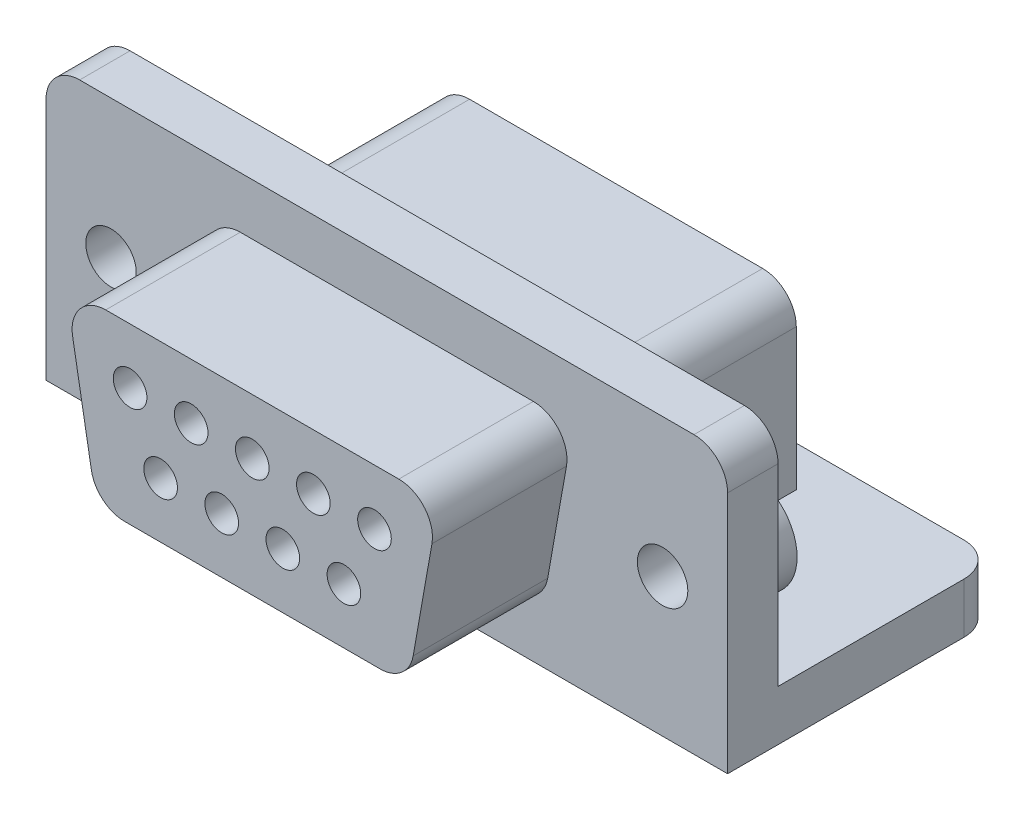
ISO-10303-21;
HEADER;
FILE_DESCRIPTION(('STEP AP214'),'2;1');
FILE_NAME('part.step','',(''),(''),'','','');
FILE_SCHEMA(('AUTOMOTIVE_DESIGN { 1 0 10303 214 1 1 1 1 }'));
ENDSEC;
DATA;
#1=APPLICATION_CONTEXT('core data for automotive mechanical design processes');
#2=APPLICATION_PROTOCOL_DEFINITION('international standard','automotive_design',2000,#1);
#3=PRODUCT_CONTEXT('',#1,'mechanical');
#4=PRODUCT('Part','Part','',(#3));
#5=PRODUCT_RELATED_PRODUCT_CATEGORY('part','',(#4));
#6=PRODUCT_DEFINITION_FORMATION('','',#4);
#7=PRODUCT_DEFINITION_CONTEXT('part definition',#1,'design');
#8=PRODUCT_DEFINITION('design','',#6,#7);
#9=PRODUCT_DEFINITION_SHAPE('','',#8);
#10=(LENGTH_UNIT() NAMED_UNIT(*) SI_UNIT(.MILLI.,.METRE.));
#11=(NAMED_UNIT(*) PLANE_ANGLE_UNIT() SI_UNIT($,.RADIAN.));
#12=(NAMED_UNIT(*) SI_UNIT($,.STERADIAN.) SOLID_ANGLE_UNIT());
#13=UNCERTAINTY_MEASURE_WITH_UNIT(LENGTH_MEASURE(1.E-05),#10,'distance_accuracy_value','');
#14=(GEOMETRIC_REPRESENTATION_CONTEXT(3) GLOBAL_UNCERTAINTY_ASSIGNED_CONTEXT((#13)) GLOBAL_UNIT_ASSIGNED_CONTEXT((#10,
#11,#12)) REPRESENTATION_CONTEXT('',''));
#15=CARTESIAN_POINT('',(0.,0.,0.));
#16=DIRECTION('',(0.,0.,1.));
#17=DIRECTION('',(1.,0.,0.));
#18=AXIS2_PLACEMENT_3D('',#15,#16,#17);
#19=CARTESIAN_POINT('',(0.,0.,0.));
#20=DIRECTION('',(0.,0.,-1.));
#21=DIRECTION('',(-1.,0.,0.));
#22=AXIS2_PLACEMENT_3D('',#19,#20,#21);
#23=PLANE('',#22);
#24=CARTESIAN_POINT('',(27.94,6.27379999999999,0.));
#25=DIRECTION('',(0.,0.,-1.));
#26=DIRECTION('',(-1.,0.,0.));
#27=AXIS2_PLACEMENT_3D('',#24,#25,#26);
#28=CIRCLE('',#27,2.286);
#29=CARTESIAN_POINT('',(30.226,6.27379999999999,0.));
#30=VERTEX_POINT('',#29);
#31=EDGE_CURVE('E256',#30,#30,#28,.T.);
#32=ORIENTED_EDGE('',*,*,#31,.F.);
#33=EDGE_LOOP('',(#32));
#34=FACE_BOUND('',#33,.T.);
#35=CARTESIAN_POINT('',(2.9464,6.27379999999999,0.));
#36=DIRECTION('',(0.,0.,-1.));
#37=DIRECTION('',(-1.,0.,0.));
#38=AXIS2_PLACEMENT_3D('',#35,#36,#37);
#39=CIRCLE('',#38,2.286);
#40=CARTESIAN_POINT('',(5.2324,6.27379999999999,0.));
#41=VERTEX_POINT('',#40);
#42=EDGE_CURVE('E260',#41,#41,#39,.T.);
#43=ORIENTED_EDGE('',*,*,#42,.F.);
#44=EDGE_LOOP('',(#43));
#45=FACE_BOUND('',#44,.T.);
#46=DIRECTION('',(-1.,0.,0.));
#47=VECTOR('',#46,1.);
#48=CARTESIAN_POINT('',(30.8864,2.286,0.));
#49=LINE('',#48,#47);
#50=CARTESIAN_POINT('',(30.8864,2.286,0.));
#51=VERTEX_POINT('',#50);
#52=CARTESIAN_POINT('',(23.5839,2.286,0.));
#53=VERTEX_POINT('',#52);
#54=EDGE_CURVE('E272',#51,#53,#49,.T.);
#55=ORIENTED_EDGE('',*,*,#54,.T.);
#56=DIRECTION('',(0.,-1.,0.));
#57=VECTOR('',#56,1.);
#58=CARTESIAN_POINT('',(23.5839,8.68679999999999,0.));
#59=LINE('',#58,#57);
#60=CARTESIAN_POINT('',(23.5839,8.68679999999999,0.));
#61=VERTEX_POINT('',#60);
#62=EDGE_CURVE('E53',#61,#53,#59,.T.);
#63=ORIENTED_EDGE('',*,*,#62,.F.);
#64=CARTESIAN_POINT('',(22.0599,8.68679999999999,0.));
#65=DIRECTION('',(0.,0.,-1.));
#66=DIRECTION('',(-1.,0.,0.));
#67=AXIS2_PLACEMENT_3D('',#64,#65,#66);
#68=CIRCLE('',#67,1.524);
#69=CARTESIAN_POINT('',(22.0599,10.2108,0.));
#70=VERTEX_POINT('',#69);
#71=EDGE_CURVE('E57',#70,#61,#68,.T.);
#72=ORIENTED_EDGE('',*,*,#71,.F.);
#73=DIRECTION('',(-1.,0.,0.));
#74=VECTOR('',#73,1.);
#75=CARTESIAN_POINT('',(22.0599,10.2108,0.));
#76=LINE('',#75,#74);
#77=CARTESIAN_POINT('',(8.7801940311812,10.2108,0.));
#78=VERTEX_POINT('',#77);
#79=EDGE_CURVE('E235',#70,#78,#76,.T.);
#80=ORIENTED_EDGE('',*,*,#79,.T.);
#81=CARTESIAN_POINT('',(8.7801940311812,8.68679999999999,0.));
#82=DIRECTION('',(0.,0.,-1.));
#83=DIRECTION('',(-1.,0.,0.));
#84=AXIS2_PLACEMENT_3D('',#81,#82,#83);
#85=CIRCLE('',#84,1.524);
#86=CARTESIAN_POINT('',(7.2561940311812,8.68679999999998,0.));
#87=VERTEX_POINT('',#86);
#88=EDGE_CURVE('E214',#87,#78,#85,.T.);
#89=ORIENTED_EDGE('',*,*,#88,.F.);
#90=DIRECTION('',(0.,-1.,0.));
#91=VECTOR('',#90,1.);
#92=CARTESIAN_POINT('',(7.2561940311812,8.68679999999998,0.));
#93=LINE('',#92,#91);
#94=CARTESIAN_POINT('',(7.2561940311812,2.286,0.));
#95=VERTEX_POINT('',#94);
#96=EDGE_CURVE('E208',#87,#95,#93,.T.);
#97=ORIENTED_EDGE('',*,*,#96,.T.);
#98=CARTESIAN_POINT('',(0.,2.286,0.));
#99=VERTEX_POINT('',#98);
#100=EDGE_CURVE('E40',#95,#99,#49,.T.);
#101=ORIENTED_EDGE('',*,*,#100,.T.);
#102=DIRECTION('',(0.,1.,0.));
#103=VECTOR('',#102,1.);
#104=CARTESIAN_POINT('',(0.,0.,0.));
#105=LINE('',#104,#103);
#106=CARTESIAN_POINT('',(0.,11.0236,0.));
#107=VERTEX_POINT('',#106);
#108=EDGE_CURVE('E283',#99,#107,#105,.T.);
#109=ORIENTED_EDGE('',*,*,#108,.T.);
#110=CARTESIAN_POINT('',(1.524,11.0236,0.));
#111=DIRECTION('',(0.,0.,-1.));
#112=DIRECTION('',(-1.,0.,0.));
#113=AXIS2_PLACEMENT_3D('',#110,#111,#112);
#114=CIRCLE('',#113,1.524);
#115=CARTESIAN_POINT('',(1.524,12.5476,0.));
#116=VERTEX_POINT('',#115);
#117=EDGE_CURVE('E356',#107,#116,#114,.T.);
#118=ORIENTED_EDGE('',*,*,#117,.T.);
#119=DIRECTION('',(-1.,0.,0.));
#120=VECTOR('',#119,1.);
#121=CARTESIAN_POINT('',(30.8864,12.5476,0.));
#122=LINE('',#121,#120);
#123=CARTESIAN_POINT('',(29.3624,12.5476,0.));
#124=VERTEX_POINT('',#123);
#125=EDGE_CURVE('E334',#124,#116,#122,.T.);
#126=ORIENTED_EDGE('',*,*,#125,.F.);
#127=CARTESIAN_POINT('',(29.3624,11.0236,0.));
#128=DIRECTION('',(0.,0.,-1.));
#129=DIRECTION('',(-1.,0.,0.));
#130=AXIS2_PLACEMENT_3D('',#127,#128,#129);
#131=CIRCLE('',#130,1.524);
#132=CARTESIAN_POINT('',(30.8864,11.0236,0.));
#133=VERTEX_POINT('',#132);
#134=EDGE_CURVE('E332',#124,#133,#131,.T.);
#135=ORIENTED_EDGE('',*,*,#134,.T.);
#136=DIRECTION('',(0.,-1.,0.));
#137=VECTOR('',#136,1.);
#138=CARTESIAN_POINT('',(30.8864,12.5476,0.));
#139=LINE('',#138,#137);
#140=EDGE_CURVE('E328',#133,#51,#139,.T.);
#141=ORIENTED_EDGE('',*,*,#140,.T.);
#142=EDGE_LOOP('',(#55,#63,#72,#80,#89,#97,#101,#109,#118,#126,#135,#141));
#143=FACE_BOUND('',#142,.T.);
#144=ADVANCED_FACE('F36',(#34,#45,#143),#23,.T.);
#145=CARTESIAN_POINT('',(30.8864,2.286,-9.9568));
#146=DIRECTION('',(0.,1.,0.));
#147=DIRECTION('',(0.,0.,1.));
#148=AXIS2_PLACEMENT_3D('',#145,#146,#147);
#149=PLANE('',#148);
#150=DIRECTION('',(-1.,0.,0.));
#151=VECTOR('',#150,1.);
#152=CARTESIAN_POINT('',(23.5839,2.286,-8.128));
#153=LINE('',#152,#151);
#154=CARTESIAN_POINT('',(23.5839,2.286,-8.128));
#155=VERTEX_POINT('',#154);
#156=CARTESIAN_POINT('',(7.2561940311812,2.286,-8.128));
#157=VERTEX_POINT('',#156);
#158=EDGE_CURVE('E230',#155,#157,#153,.T.);
#159=ORIENTED_EDGE('',*,*,#158,.F.);
#160=DIRECTION('',(0.,0.,1.));
#161=VECTOR('',#160,1.);
#162=CARTESIAN_POINT('',(23.5839,2.286,-8.128));
#163=LINE('',#162,#161);
#164=EDGE_CURVE('E245',#155,#53,#163,.T.);
#165=ORIENTED_EDGE('',*,*,#164,.T.);
#166=ORIENTED_EDGE('',*,*,#54,.F.);
#167=DIRECTION('',(0.,0.,1.));
#168=VECTOR('',#167,1.);
#169=CARTESIAN_POINT('',(30.8864,2.286,-9.9568));
#170=LINE('',#169,#168);
#171=CARTESIAN_POINT('',(30.8864,2.286,-8.4328));
#172=VERTEX_POINT('',#171);
#173=EDGE_CURVE('E274',#172,#51,#170,.T.);
#174=ORIENTED_EDGE('',*,*,#173,.F.);
#175=CARTESIAN_POINT('',(29.3624,2.286,-8.4328));
#176=DIRECTION('',(0.,1.,0.));
#177=DIRECTION('',(0.,0.,1.));
#178=AXIS2_PLACEMENT_3D('',#175,#176,#177);
#179=CIRCLE('',#178,1.524);
#180=CARTESIAN_POINT('',(29.3624,2.286,-9.9568));
#181=VERTEX_POINT('',#180);
#182=EDGE_CURVE('E46',#172,#181,#179,.T.);
#183=ORIENTED_EDGE('',*,*,#182,.T.);
#184=DIRECTION('',(-1.,0.,0.));
#185=VECTOR('',#184,1.);
#186=CARTESIAN_POINT('',(30.8864,2.286,-9.9568));
#187=LINE('',#186,#185);
#188=CARTESIAN_POINT('',(1.524,2.286,-9.9568));
#189=VERTEX_POINT('',#188);
#190=EDGE_CURVE('E268',#181,#189,#187,.T.);
#191=ORIENTED_EDGE('',*,*,#190,.T.);
#192=CARTESIAN_POINT('',(1.524,2.286,-8.4328));
#193=DIRECTION('',(0.,1.,0.));
#194=DIRECTION('',(0.,0.,1.));
#195=AXIS2_PLACEMENT_3D('',#192,#193,#194);
#196=CIRCLE('',#195,1.524);
#197=CARTESIAN_POINT('',(0.,2.286,-8.4328));
#198=VERTEX_POINT('',#197);
#199=EDGE_CURVE('E297',#189,#198,#196,.T.);
#200=ORIENTED_EDGE('',*,*,#199,.T.);
#201=DIRECTION('',(0.,0.,1.));
#202=VECTOR('',#201,1.);
#203=CARTESIAN_POINT('',(0.,2.286,-9.9568));
#204=LINE('',#203,#202);
#205=EDGE_CURVE('E291',#198,#99,#204,.T.);
#206=ORIENTED_EDGE('',*,*,#205,.T.);
#207=ORIENTED_EDGE('',*,*,#100,.F.);
#208=DIRECTION('',(0.,0.,1.));
#209=VECTOR('',#208,1.);
#210=CARTESIAN_POINT('',(7.2561940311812,2.286,-8.128));
#211=LINE('',#210,#209);
#212=EDGE_CURVE('E242',#157,#95,#211,.T.);
#213=ORIENTED_EDGE('',*,*,#212,.F.);
#214=EDGE_LOOP('',(#159,#165,#166,#174,#183,#191,#200,#206,#207,#213));
#215=FACE_BOUND('',#214,.T.);
#216=ADVANCED_FACE('F303',(#215),#149,.T.);
#217=CARTESIAN_POINT('',(0.,0.,2.286));
#218=DIRECTION('',(-1.,0.,0.));
#219=DIRECTION('',(0.,0.,1.));
#220=AXIS2_PLACEMENT_3D('',#217,#218,#219);
#221=PLANE('',#220);
#222=ORIENTED_EDGE('',*,*,#205,.F.);
#223=DIRECTION('',(0.,1.,0.));
#224=VECTOR('',#223,1.);
#225=CARTESIAN_POINT('',(0.,0.,-8.4328));
#226=LINE('',#225,#224);
#227=CARTESIAN_POINT('',(0.,0.,-8.4328));
#228=VERTEX_POINT('',#227);
#229=EDGE_CURVE('E11',#198,#228,#226,.F.);
#230=ORIENTED_EDGE('',*,*,#229,.T.);
#231=DIRECTION('',(0.,0.,-1.));
#232=VECTOR('',#231,1.);
#233=CARTESIAN_POINT('',(0.,0.,2.286));
#234=LINE('',#233,#232);
#235=CARTESIAN_POINT('',(0.,0.,2.286));
#236=VERTEX_POINT('',#235);
#237=EDGE_CURVE('E345',#236,#228,#234,.T.);
#238=ORIENTED_EDGE('',*,*,#237,.F.);
#239=DIRECTION('',(0.,1.,0.));
#240=VECTOR('',#239,1.);
#241=CARTESIAN_POINT('',(0.,0.,2.286));
#242=LINE('',#241,#240);
#243=CARTESIAN_POINT('',(0.,11.0236,2.286));
#244=VERTEX_POINT('',#243);
#245=EDGE_CURVE('E333',#236,#244,#242,.T.);
#246=ORIENTED_EDGE('',*,*,#245,.T.);
#247=DIRECTION('',(0.,0.,-1.));
#248=VECTOR('',#247,1.);
#249=CARTESIAN_POINT('',(0.,11.0236,0.));
#250=LINE('',#249,#248);
#251=EDGE_CURVE('E321',#244,#107,#250,.T.);
#252=ORIENTED_EDGE('',*,*,#251,.T.);
#253=ORIENTED_EDGE('',*,*,#108,.F.);
#254=EDGE_LOOP('',(#222,#230,#238,#246,#252,#253));
#255=FACE_BOUND('',#254,.T.);
#256=ADVANCED_FACE('F373',(#255),#221,.T.);
#257=CARTESIAN_POINT('',(0.,0.,2.286));
#258=DIRECTION('',(0.,1.,0.));
#259=DIRECTION('',(0.,0.,1.));
#260=AXIS2_PLACEMENT_3D('',#257,#258,#259);
#261=PLANE('',#260);
#262=DIRECTION('',(1.,0.,0.));
#263=VECTOR('',#262,1.);
#264=CARTESIAN_POINT('',(0.,0.,-9.9568));
#265=LINE('',#264,#263);
#266=CARTESIAN_POINT('',(1.524,0.,-9.9568));
#267=VERTEX_POINT('',#266);
#268=CARTESIAN_POINT('',(29.3624,0.,-9.9568));
#269=VERTEX_POINT('',#268);
#270=EDGE_CURVE('E271',#267,#269,#265,.T.);
#271=ORIENTED_EDGE('',*,*,#270,.T.);
#272=CARTESIAN_POINT('',(29.3624,0.,-8.4328));
#273=DIRECTION('',(0.,1.,0.));
#274=DIRECTION('',(0.,0.,1.));
#275=AXIS2_PLACEMENT_3D('',#272,#273,#274);
#276=CIRCLE('',#275,1.524);
#277=CARTESIAN_POINT('',(30.8864,0.,-8.4328));
#278=VERTEX_POINT('',#277);
#279=EDGE_CURVE('E317',#269,#278,#276,.F.);
#280=ORIENTED_EDGE('',*,*,#279,.T.);
#281=DIRECTION('',(0.,0.,-1.));
#282=VECTOR('',#281,1.);
#283=CARTESIAN_POINT('',(30.8864,0.,2.286));
#284=LINE('',#283,#282);
#285=CARTESIAN_POINT('',(30.8864,0.,2.286));
#286=VERTEX_POINT('',#285);
#287=EDGE_CURVE('E349',#286,#278,#284,.T.);
#288=ORIENTED_EDGE('',*,*,#287,.F.);
#289=DIRECTION('',(1.,0.,0.));
#290=VECTOR('',#289,1.);
#291=CARTESIAN_POINT('',(0.,0.,2.286));
#292=LINE('',#291,#290);
#293=EDGE_CURVE('E351',#236,#286,#292,.T.);
#294=ORIENTED_EDGE('',*,*,#293,.F.);
#295=ORIENTED_EDGE('',*,*,#237,.T.);
#296=CARTESIAN_POINT('',(1.524,0.,-8.4328));
#297=DIRECTION('',(0.,1.,0.));
#298=DIRECTION('',(0.,0.,1.));
#299=AXIS2_PLACEMENT_3D('',#296,#297,#298);
#300=CIRCLE('',#299,1.524);
#301=EDGE_CURVE('E318',#228,#267,#300,.F.);
#302=ORIENTED_EDGE('',*,*,#301,.T.);
#303=EDGE_LOOP('',(#271,#280,#288,#294,#295,#302));
#304=FACE_BOUND('',#303,.T.);
#305=ADVANCED_FACE('F530',(#304),#261,.F.);
#306=CARTESIAN_POINT('',(30.8864,12.5476,2.286));
#307=DIRECTION('',(1.,0.,0.));
#308=DIRECTION('',(0.,1.,0.));
#309=AXIS2_PLACEMENT_3D('',#306,#307,#308);
#310=PLANE('',#309);
#311=ORIENTED_EDGE('',*,*,#287,.T.);
#312=DIRECTION('',(0.,-1.,0.));
#313=VECTOR('',#312,1.);
#314=CARTESIAN_POINT('',(30.8864,2.286,-8.4328));
#315=LINE('',#314,#313);
#316=EDGE_CURVE('E295',#278,#172,#315,.F.);
#317=ORIENTED_EDGE('',*,*,#316,.T.);
#318=ORIENTED_EDGE('',*,*,#173,.T.);
#319=ORIENTED_EDGE('',*,*,#140,.F.);
#320=DIRECTION('',(0.,0.,-1.));
#321=VECTOR('',#320,1.);
#322=CARTESIAN_POINT('',(30.8864,11.0236,2.286));
#323=LINE('',#322,#321);
#324=CARTESIAN_POINT('',(30.8864,11.0236,2.286));
#325=VERTEX_POINT('',#324);
#326=EDGE_CURVE('E359',#133,#325,#323,.F.);
#327=ORIENTED_EDGE('',*,*,#326,.T.);
#328=DIRECTION('',(0.,-1.,0.));
#329=VECTOR('',#328,1.);
#330=CARTESIAN_POINT('',(30.8864,12.5476,2.286));
#331=LINE('',#330,#329);
#332=EDGE_CURVE('E385',#325,#286,#331,.T.);
#333=ORIENTED_EDGE('',*,*,#332,.T.);
#334=EDGE_LOOP('',(#311,#317,#318,#319,#327,#333));
#335=FACE_BOUND('',#334,.T.);
#336=ADVANCED_FACE('F326',(#335),#310,.T.);
#337=CARTESIAN_POINT('',(30.8864,12.5476,2.286));
#338=DIRECTION('',(0.,-1.,0.));
#339=DIRECTION('',(1.,0.,0.));
#340=AXIS2_PLACEMENT_3D('',#337,#338,#339);
#341=PLANE('',#340);
#342=DIRECTION('',(-1.,0.,0.));
#343=VECTOR('',#342,1.);
#344=CARTESIAN_POINT('',(30.8864,12.5476,2.286));
#345=LINE('',#344,#343);
#346=CARTESIAN_POINT('',(29.3624,12.5476,2.286));
#347=VERTEX_POINT('',#346);
#348=CARTESIAN_POINT('',(1.524,12.5476,2.286));
#349=VERTEX_POINT('',#348);
#350=EDGE_CURVE('E336',#347,#349,#345,.T.);
#351=ORIENTED_EDGE('',*,*,#350,.F.);
#352=DIRECTION('',(0.,0.,-1.));
#353=VECTOR('',#352,1.);
#354=CARTESIAN_POINT('',(29.3624,12.5476,0.));
#355=LINE('',#354,#353);
#356=EDGE_CURVE('E353',#347,#124,#355,.T.);
#357=ORIENTED_EDGE('',*,*,#356,.T.);
#358=ORIENTED_EDGE('',*,*,#125,.T.);
#359=DIRECTION('',(0.,0.,-1.));
#360=VECTOR('',#359,1.);
#361=CARTESIAN_POINT('',(1.524,12.5476,2.286));
#362=LINE('',#361,#360);
#363=EDGE_CURVE('E348',#116,#349,#362,.F.);
#364=ORIENTED_EDGE('',*,*,#363,.T.);
#365=EDGE_LOOP('',(#351,#357,#358,#364));
#366=FACE_BOUND('',#365,.T.);
#367=ADVANCED_FACE('F381',(#366),#341,.F.);
#368=CARTESIAN_POINT('',(0.,0.,2.286));
#369=DIRECTION('',(0.,0.,-1.));
#370=DIRECTION('',(-1.,0.,0.));
#371=AXIS2_PLACEMENT_3D('',#368,#369,#370);
#372=PLANE('',#371);
#373=CARTESIAN_POINT('',(2.9464,6.27379999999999,2.286));
#374=DIRECTION('',(0.,0.,1.));
#375=DIRECTION('',(1.,0.,0.));
#376=AXIS2_PLACEMENT_3D('',#373,#374,#375);
#377=CIRCLE('',#376,1.143);
#378=CARTESIAN_POINT('',(4.0894,6.27379999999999,2.286));
#379=VERTEX_POINT('',#378);
#380=EDGE_CURVE('E277',#379,#379,#377,.T.);
#381=ORIENTED_EDGE('',*,*,#380,.F.);
#382=EDGE_LOOP('',(#381));
#383=FACE_BOUND('',#382,.T.);
#384=CARTESIAN_POINT('',(27.94,6.27379999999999,2.286));
#385=DIRECTION('',(0.,0.,1.));
#386=DIRECTION('',(1.,0.,0.));
#387=AXIS2_PLACEMENT_3D('',#384,#385,#386);
#388=CIRCLE('',#387,1.143);
#389=CARTESIAN_POINT('',(29.083,6.27379999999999,2.286));
#390=VERTEX_POINT('',#389);
#391=EDGE_CURVE('E443',#390,#390,#388,.T.);
#392=ORIENTED_EDGE('',*,*,#391,.F.);
#393=EDGE_LOOP('',(#392));
#394=FACE_BOUND('',#393,.T.);
#395=DIRECTION('',(0.173648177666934,-0.984807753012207,0.));
#396=VECTOR('',#395,1.);
#397=CARTESIAN_POINT('',(7.3025,8.42216017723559,2.286));
#398=LINE('',#397,#396);
#399=CARTESIAN_POINT('',(7.3025,8.42216017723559,2.286));
#400=VERTEX_POINT('',#399);
#401=CARTESIAN_POINT('',(8.15345400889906,3.59616017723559,2.286));
#402=VERTEX_POINT('',#401);
#403=EDGE_CURVE('E420',#400,#402,#398,.T.);
#404=ORIENTED_EDGE('',*,*,#403,.F.);
#405=CARTESIAN_POINT('',(8.8033470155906,8.6868,2.286));
#406=DIRECTION('',(0.,0.,-1.));
#407=DIRECTION('',(-1.,0.,0.));
#408=AXIS2_PLACEMENT_3D('',#405,#406,#407);
#409=CIRCLE('',#408,1.524);
#410=CARTESIAN_POINT('',(8.8033470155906,10.2108,2.286));
#411=VERTEX_POINT('',#410);
#412=EDGE_CURVE('E441',#400,#411,#409,.T.);
#413=ORIENTED_EDGE('',*,*,#412,.T.);
#414=DIRECTION('',(-1.,0.,0.));
#415=VECTOR('',#414,1.);
#416=CARTESIAN_POINT('',(22.0830529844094,10.2108,2.286));
#417=LINE('',#416,#415);
#418=CARTESIAN_POINT('',(22.0830529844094,10.2108,2.286));
#419=VERTEX_POINT('',#418);
#420=EDGE_CURVE('E438',#419,#411,#417,.T.);
#421=ORIENTED_EDGE('',*,*,#420,.F.);
#422=CARTESIAN_POINT('',(22.0830529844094,8.6868,2.286));
#423=DIRECTION('',(0.,0.,1.));
#424=DIRECTION('',(1.,0.,0.));
#425=AXIS2_PLACEMENT_3D('',#422,#423,#424);
#426=CIRCLE('',#425,1.524);
#427=CARTESIAN_POINT('',(23.5839,8.42216017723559,2.286));
#428=VERTEX_POINT('',#427);
#429=EDGE_CURVE('E435',#428,#419,#426,.T.);
#430=ORIENTED_EDGE('',*,*,#429,.F.);
#431=DIRECTION('',(0.173648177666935,0.984807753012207,0.));
#432=VECTOR('',#431,1.);
#433=CARTESIAN_POINT('',(22.7329459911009,3.59616017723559,2.286));
#434=LINE('',#433,#432);
#435=CARTESIAN_POINT('',(22.7329459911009,3.59616017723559,2.286));
#436=VERTEX_POINT('',#435);
#437=EDGE_CURVE('E432',#436,#428,#434,.T.);
#438=ORIENTED_EDGE('',*,*,#437,.F.);
#439=CARTESIAN_POINT('',(21.2320989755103,3.8608,2.286));
#440=DIRECTION('',(0.,0.,-1.));
#441=DIRECTION('',(-1.,0.,0.));
#442=AXIS2_PLACEMENT_3D('',#439,#440,#441);
#443=CIRCLE('',#442,1.524);
#444=CARTESIAN_POINT('',(21.2320989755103,2.3368,2.286));
#445=VERTEX_POINT('',#444);
#446=EDGE_CURVE('E430',#436,#445,#443,.T.);
#447=ORIENTED_EDGE('',*,*,#446,.T.);
#448=DIRECTION('',(1.,0.,0.));
#449=VECTOR('',#448,1.);
#450=CARTESIAN_POINT('',(9.65430102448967,2.3368,2.286));
#451=LINE('',#450,#449);
#452=CARTESIAN_POINT('',(9.65430102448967,2.3368,2.286));
#453=VERTEX_POINT('',#452);
#454=EDGE_CURVE('E427',#453,#445,#451,.T.);
#455=ORIENTED_EDGE('',*,*,#454,.F.);
#456=CARTESIAN_POINT('',(9.65430102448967,3.8608,2.286));
#457=DIRECTION('',(0.,0.,1.));
#458=DIRECTION('',(1.,0.,0.));
#459=AXIS2_PLACEMENT_3D('',#456,#457,#458);
#460=CIRCLE('',#459,1.524);
#461=EDGE_CURVE('E424',#402,#453,#460,.T.);
#462=ORIENTED_EDGE('',*,*,#461,.F.);
#463=EDGE_LOOP('',(#404,#413,#421,#430,#438,#447,#455,#462));
#464=FACE_BOUND('',#463,.T.);
#465=ORIENTED_EDGE('',*,*,#332,.F.);
#466=CARTESIAN_POINT('',(29.3624,11.0236,2.286));
#467=DIRECTION('',(0.,0.,-1.));
#468=DIRECTION('',(-1.,0.,0.));
#469=AXIS2_PLACEMENT_3D('',#466,#467,#468);
#470=CIRCLE('',#469,1.524);
#471=EDGE_CURVE('E362',#325,#347,#470,.F.);
#472=ORIENTED_EDGE('',*,*,#471,.T.);
#473=ORIENTED_EDGE('',*,*,#350,.T.);
#474=CARTESIAN_POINT('',(1.524,11.0236,2.286));
#475=DIRECTION('',(0.,0.,-1.));
#476=DIRECTION('',(-1.,0.,0.));
#477=AXIS2_PLACEMENT_3D('',#474,#475,#476);
#478=CIRCLE('',#477,1.524);
#479=EDGE_CURVE('E361',#349,#244,#478,.F.);
#480=ORIENTED_EDGE('',*,*,#479,.T.);
#481=ORIENTED_EDGE('',*,*,#245,.F.);
#482=ORIENTED_EDGE('',*,*,#293,.T.);
#483=EDGE_LOOP('',(#465,#472,#473,#480,#481,#482));
#484=FACE_BOUND('',#483,.T.);
#485=ADVANCED_FACE('F387',(#383,#394,#464,#484),#372,.F.);
#486=CARTESIAN_POINT('',(29.3624,11.0236,2.286));
#487=DIRECTION('',(0.,0.,1.));
#488=DIRECTION('',(1.,0.,0.));
#489=AXIS2_PLACEMENT_3D('',#486,#487,#488);
#490=CYLINDRICAL_SURFACE('',#489,1.524);
#491=ORIENTED_EDGE('',*,*,#471,.F.);
#492=ORIENTED_EDGE('',*,*,#326,.F.);
#493=ORIENTED_EDGE('',*,*,#134,.F.);
#494=ORIENTED_EDGE('',*,*,#356,.F.);
#495=EDGE_LOOP('',(#491,#492,#493,#494));
#496=FACE_BOUND('',#495,.T.);
#497=ADVANCED_FACE('F384',(#496),#490,.T.);
#498=CARTESIAN_POINT('',(1.524,11.0236,2.286));
#499=DIRECTION('',(0.,0.,1.));
#500=DIRECTION('',(1.,0.,0.));
#501=AXIS2_PLACEMENT_3D('',#498,#499,#500);
#502=CYLINDRICAL_SURFACE('',#501,1.524);
#503=ORIENTED_EDGE('',*,*,#479,.F.);
#504=ORIENTED_EDGE('',*,*,#363,.F.);
#505=ORIENTED_EDGE('',*,*,#117,.F.);
#506=ORIENTED_EDGE('',*,*,#251,.F.);
#507=EDGE_LOOP('',(#503,#504,#505,#506));
#508=FACE_BOUND('',#507,.T.);
#509=ADVANCED_FACE('F378',(#508),#502,.T.);
#510=CARTESIAN_POINT('',(8.8033470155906,8.6868,8.382));
#511=DIRECTION('',(0.,0.,-1.));
#512=DIRECTION('',(-1.,0.,0.));
#513=AXIS2_PLACEMENT_3D('',#510,#511,#512);
#514=CYLINDRICAL_SURFACE('',#513,1.524);
#515=ORIENTED_EDGE('',*,*,#412,.F.);
#516=DIRECTION('',(0.,0.,-1.));
#517=VECTOR('',#516,1.);
#518=CARTESIAN_POINT('',(7.3025,8.42216017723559,8.382));
#519=LINE('',#518,#517);
#520=CARTESIAN_POINT('',(7.3025,8.42216017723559,8.382));
#521=VERTEX_POINT('',#520);
#522=EDGE_CURVE('E417',#521,#400,#519,.T.);
#523=ORIENTED_EDGE('',*,*,#522,.F.);
#524=CARTESIAN_POINT('',(8.8033470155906,8.6868,8.382));
#525=DIRECTION('',(0.,0.,-1.));
#526=DIRECTION('',(-1.,0.,0.));
#527=AXIS2_PLACEMENT_3D('',#524,#525,#526);
#528=CIRCLE('',#527,1.524);
#529=CARTESIAN_POINT('',(8.8033470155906,10.2108,8.382));
#530=VERTEX_POINT('',#529);
#531=EDGE_CURVE('E423',#521,#530,#528,.T.);
#532=ORIENTED_EDGE('',*,*,#531,.T.);
#533=DIRECTION('',(0.,0.,-1.));
#534=VECTOR('',#533,1.);
#535=CARTESIAN_POINT('',(8.8033470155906,10.2108,8.382));
#536=LINE('',#535,#534);
#537=EDGE_CURVE('E395',#530,#411,#536,.T.);
#538=ORIENTED_EDGE('',*,*,#537,.T.);
#539=EDGE_LOOP('',(#515,#523,#532,#538));
#540=FACE_BOUND('',#539,.T.);
#541=ADVANCED_FACE('F479',(#540),#514,.T.);
#542=CARTESIAN_POINT('',(7.3025,8.42216017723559,8.382));
#543=DIRECTION('',(0.984807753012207,0.173648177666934,0.));
#544=DIRECTION('',(-0.173648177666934,0.984807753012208,0.));
#545=AXIS2_PLACEMENT_3D('',#542,#543,#544);
#546=PLANE('',#545);
#547=ORIENTED_EDGE('',*,*,#403,.T.);
#548=DIRECTION('',(0.,0.,-1.));
#549=VECTOR('',#548,1.);
#550=CARTESIAN_POINT('',(8.15345400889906,3.59616017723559,8.382));
#551=LINE('',#550,#549);
#552=CARTESIAN_POINT('',(8.15345400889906,3.59616017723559,8.382));
#553=VERTEX_POINT('',#552);
#554=EDGE_CURVE('E414',#553,#402,#551,.T.);
#555=ORIENTED_EDGE('',*,*,#554,.F.);
#556=DIRECTION('',(0.173648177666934,-0.984807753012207,0.));
#557=VECTOR('',#556,1.);
#558=CARTESIAN_POINT('',(7.3025,8.42216017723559,8.382));
#559=LINE('',#558,#557);
#560=EDGE_CURVE('E399',#521,#553,#559,.T.);
#561=ORIENTED_EDGE('',*,*,#560,.F.);
#562=ORIENTED_EDGE('',*,*,#522,.T.);
#563=EDGE_LOOP('',(#547,#555,#561,#562));
#564=FACE_BOUND('',#563,.T.);
#565=ADVANCED_FACE('F476',(#564),#546,.F.);
#566=CARTESIAN_POINT('',(9.65430102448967,3.8608,8.382));
#567=DIRECTION('',(0.,0.,-1.));
#568=DIRECTION('',(-1.,0.,0.));
#569=AXIS2_PLACEMENT_3D('',#566,#567,#568);
#570=CYLINDRICAL_SURFACE('',#569,1.524);
#571=ORIENTED_EDGE('',*,*,#461,.T.);
#572=DIRECTION('',(0.,0.,-1.));
#573=VECTOR('',#572,1.);
#574=CARTESIAN_POINT('',(9.65430102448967,2.3368,8.382));
#575=LINE('',#574,#573);
#576=CARTESIAN_POINT('',(9.65430102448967,2.3368,8.382));
#577=VERTEX_POINT('',#576);
#578=EDGE_CURVE('E411',#577,#453,#575,.T.);
#579=ORIENTED_EDGE('',*,*,#578,.F.);
#580=CARTESIAN_POINT('',(9.65430102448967,3.8608,8.382));
#581=DIRECTION('',(0.,0.,1.));
#582=DIRECTION('',(1.,0.,0.));
#583=AXIS2_PLACEMENT_3D('',#580,#581,#582);
#584=CIRCLE('',#583,1.524);
#585=EDGE_CURVE('E445',#553,#577,#584,.T.);
#586=ORIENTED_EDGE('',*,*,#585,.F.);
#587=ORIENTED_EDGE('',*,*,#554,.T.);
#588=EDGE_LOOP('',(#571,#579,#586,#587));
#589=FACE_BOUND('',#588,.T.);
#590=ADVANCED_FACE('F503',(#589),#570,.T.);
#591=CARTESIAN_POINT('',(9.65430102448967,2.3368,8.382));
#592=DIRECTION('',(0.,1.,0.));
#593=DIRECTION('',(-1.,0.,0.));
#594=AXIS2_PLACEMENT_3D('',#591,#592,#593);
#595=PLANE('',#594);
#596=ORIENTED_EDGE('',*,*,#454,.T.);
#597=DIRECTION('',(0.,0.,-1.));
#598=VECTOR('',#597,1.);
#599=CARTESIAN_POINT('',(21.2320989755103,2.3368,8.382));
#600=LINE('',#599,#598);
#601=CARTESIAN_POINT('',(21.2320989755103,2.3368,8.382));
#602=VERTEX_POINT('',#601);
#603=EDGE_CURVE('E408',#602,#445,#600,.T.);
#604=ORIENTED_EDGE('',*,*,#603,.F.);
#605=DIRECTION('',(1.,0.,0.));
#606=VECTOR('',#605,1.);
#607=CARTESIAN_POINT('',(9.65430102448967,2.3368,8.382));
#608=LINE('',#607,#606);
#609=EDGE_CURVE('E447',#577,#602,#608,.T.);
#610=ORIENTED_EDGE('',*,*,#609,.F.);
#611=ORIENTED_EDGE('',*,*,#578,.T.);
#612=EDGE_LOOP('',(#596,#604,#610,#611));
#613=FACE_BOUND('',#612,.T.);
#614=ADVANCED_FACE('F499',(#613),#595,.F.);
#615=CARTESIAN_POINT('',(21.2320989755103,3.8608,8.382));
#616=DIRECTION('',(0.,0.,-1.));
#617=DIRECTION('',(-1.,0.,0.));
#618=AXIS2_PLACEMENT_3D('',#615,#616,#617);
#619=CYLINDRICAL_SURFACE('',#618,1.524);
#620=ORIENTED_EDGE('',*,*,#446,.F.);
#621=DIRECTION('',(0.,0.,-1.));
#622=VECTOR('',#621,1.);
#623=CARTESIAN_POINT('',(22.7329459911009,3.59616017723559,8.382));
#624=LINE('',#623,#622);
#625=CARTESIAN_POINT('',(22.7329459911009,3.59616017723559,8.382));
#626=VERTEX_POINT('',#625);
#627=EDGE_CURVE('E405',#626,#436,#624,.T.);
#628=ORIENTED_EDGE('',*,*,#627,.F.);
#629=CARTESIAN_POINT('',(21.2320989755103,3.8608,8.382));
#630=DIRECTION('',(0.,0.,-1.));
#631=DIRECTION('',(-1.,0.,0.));
#632=AXIS2_PLACEMENT_3D('',#629,#630,#631);
#633=CIRCLE('',#632,1.524);
#634=EDGE_CURVE('E449',#626,#602,#633,.T.);
#635=ORIENTED_EDGE('',*,*,#634,.T.);
#636=ORIENTED_EDGE('',*,*,#603,.T.);
#637=EDGE_LOOP('',(#620,#628,#635,#636));
#638=FACE_BOUND('',#637,.T.);
#639=ADVANCED_FACE('F496',(#638),#619,.T.);
#640=CARTESIAN_POINT('',(22.7329459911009,3.59616017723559,8.382));
#641=DIRECTION('',(-0.984807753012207,0.173648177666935,0.));
#642=DIRECTION('',(-0.173648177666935,-0.984807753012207,0.));
#643=AXIS2_PLACEMENT_3D('',#640,#641,#642);
#644=PLANE('',#643);
#645=ORIENTED_EDGE('',*,*,#437,.T.);
#646=DIRECTION('',(0.,0.,-1.));
#647=VECTOR('',#646,1.);
#648=CARTESIAN_POINT('',(23.5839,8.42216017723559,8.382));
#649=LINE('',#648,#647);
#650=CARTESIAN_POINT('',(23.5839,8.42216017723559,8.382));
#651=VERTEX_POINT('',#650);
#652=EDGE_CURVE('E402',#651,#428,#649,.T.);
#653=ORIENTED_EDGE('',*,*,#652,.F.);
#654=DIRECTION('',(0.173648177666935,0.984807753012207,0.));
#655=VECTOR('',#654,1.);
#656=CARTESIAN_POINT('',(22.7329459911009,3.59616017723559,8.382));
#657=LINE('',#656,#655);
#658=EDGE_CURVE('E452',#626,#651,#657,.T.);
#659=ORIENTED_EDGE('',*,*,#658,.F.);
#660=ORIENTED_EDGE('',*,*,#627,.T.);
#661=EDGE_LOOP('',(#645,#653,#659,#660));
#662=FACE_BOUND('',#661,.T.);
#663=ADVANCED_FACE('F491',(#662),#644,.F.);
#664=CARTESIAN_POINT('',(22.0830529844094,8.6868,8.382));
#665=DIRECTION('',(0.,0.,-1.));
#666=DIRECTION('',(-1.,0.,0.));
#667=AXIS2_PLACEMENT_3D('',#664,#665,#666);
#668=CYLINDRICAL_SURFACE('',#667,1.524);
#669=ORIENTED_EDGE('',*,*,#429,.T.);
#670=DIRECTION('',(0.,0.,-1.));
#671=VECTOR('',#670,1.);
#672=CARTESIAN_POINT('',(22.0830529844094,10.2108,8.382));
#673=LINE('',#672,#671);
#674=CARTESIAN_POINT('',(22.0830529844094,10.2108,8.382));
#675=VERTEX_POINT('',#674);
#676=EDGE_CURVE('E398',#675,#419,#673,.T.);
#677=ORIENTED_EDGE('',*,*,#676,.F.);
#678=CARTESIAN_POINT('',(22.0830529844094,8.6868,8.382));
#679=DIRECTION('',(0.,0.,1.));
#680=DIRECTION('',(1.,0.,0.));
#681=AXIS2_PLACEMENT_3D('',#678,#679,#680);
#682=CIRCLE('',#681,1.524);
#683=EDGE_CURVE('E454',#651,#675,#682,.T.);
#684=ORIENTED_EDGE('',*,*,#683,.F.);
#685=ORIENTED_EDGE('',*,*,#652,.T.);
#686=EDGE_LOOP('',(#669,#677,#684,#685));
#687=FACE_BOUND('',#686,.T.);
#688=ADVANCED_FACE('F486',(#687),#668,.T.);
#689=CARTESIAN_POINT('',(22.0830529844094,10.2108,8.382));
#690=DIRECTION('',(0.,-1.,0.));
#691=DIRECTION('',(1.,0.,0.));
#692=AXIS2_PLACEMENT_3D('',#689,#690,#691);
#693=PLANE('',#692);
#694=ORIENTED_EDGE('',*,*,#420,.T.);
#695=ORIENTED_EDGE('',*,*,#537,.F.);
#696=DIRECTION('',(-1.,0.,0.));
#697=VECTOR('',#696,1.);
#698=CARTESIAN_POINT('',(22.0830529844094,10.2108,8.382));
#699=LINE('',#698,#697);
#700=EDGE_CURVE('E456',#675,#530,#699,.T.);
#701=ORIENTED_EDGE('',*,*,#700,.F.);
#702=ORIENTED_EDGE('',*,*,#676,.T.);
#703=EDGE_LOOP('',(#694,#695,#701,#702));
#704=FACE_BOUND('',#703,.T.);
#705=ADVANCED_FACE('F483',(#704),#693,.F.);
#706=CARTESIAN_POINT('',(8.8033470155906,8.6868,8.382));
#707=DIRECTION('',(0.,0.,-1.));
#708=DIRECTION('',(-1.,0.,0.));
#709=AXIS2_PLACEMENT_3D('',#706,#707,#708);
#710=PLANE('',#709);
#711=CARTESIAN_POINT('',(20.9804,7.69619999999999,8.382));
#712=DIRECTION('',(0.,0.,1.));
#713=DIRECTION('',(1.,0.,0.));
#714=AXIS2_PLACEMENT_3D('',#711,#712,#713);
#715=CIRCLE('',#714,0.762000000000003);
#716=CARTESIAN_POINT('',(21.7424,7.69619999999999,8.382));
#717=VERTEX_POINT('',#716);
#718=EDGE_CURVE('E666',#717,#717,#715,.T.);
#719=ORIENTED_EDGE('',*,*,#718,.F.);
#720=EDGE_LOOP('',(#719));
#721=FACE_BOUND('',#720,.T.);
#722=CARTESIAN_POINT('',(19.5961,4.85139999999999,8.382));
#723=DIRECTION('',(0.,0.,1.));
#724=DIRECTION('',(1.,0.,0.));
#725=AXIS2_PLACEMENT_3D('',#722,#723,#724);
#726=CIRCLE('',#725,0.762000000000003);
#727=CARTESIAN_POINT('',(20.3581,4.85139999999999,8.382));
#728=VERTEX_POINT('',#727);
#729=EDGE_CURVE('E665',#728,#728,#726,.T.);
#730=ORIENTED_EDGE('',*,*,#729,.F.);
#731=EDGE_LOOP('',(#730));
#732=FACE_BOUND('',#731,.T.);
#733=CARTESIAN_POINT('',(18.2118,7.69619999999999,8.382));
#734=DIRECTION('',(0.,0.,1.));
#735=DIRECTION('',(1.,0.,0.));
#736=AXIS2_PLACEMENT_3D('',#733,#734,#735);
#737=CIRCLE('',#736,0.762000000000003);
#738=CARTESIAN_POINT('',(18.9738,7.69619999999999,8.382));
#739=VERTEX_POINT('',#738);
#740=EDGE_CURVE('E675',#739,#739,#737,.T.);
#741=ORIENTED_EDGE('',*,*,#740,.F.);
#742=EDGE_LOOP('',(#741));
#743=FACE_BOUND('',#742,.T.);
#744=CARTESIAN_POINT('',(16.8275,4.85139999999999,8.382));
#745=DIRECTION('',(0.,0.,1.));
#746=DIRECTION('',(1.,0.,0.));
#747=AXIS2_PLACEMENT_3D('',#744,#745,#746);
#748=CIRCLE('',#747,0.762000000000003);
#749=CARTESIAN_POINT('',(17.5895,4.85139999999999,8.382));
#750=VERTEX_POINT('',#749);
#751=EDGE_CURVE('E680',#750,#750,#748,.T.);
#752=ORIENTED_EDGE('',*,*,#751,.F.);
#753=EDGE_LOOP('',(#752));
#754=FACE_BOUND('',#753,.T.);
#755=CARTESIAN_POINT('',(15.4432,7.69619999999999,8.382));
#756=DIRECTION('',(0.,0.,1.));
#757=DIRECTION('',(1.,0.,0.));
#758=AXIS2_PLACEMENT_3D('',#755,#756,#757);
#759=CIRCLE('',#758,0.762000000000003);
#760=CARTESIAN_POINT('',(16.2052,7.69619999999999,8.382));
#761=VERTEX_POINT('',#760);
#762=EDGE_CURVE('E686',#761,#761,#759,.T.);
#763=ORIENTED_EDGE('',*,*,#762,.F.);
#764=EDGE_LOOP('',(#763));
#765=FACE_BOUND('',#764,.T.);
#766=CARTESIAN_POINT('',(14.0589,4.85139999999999,8.382));
#767=DIRECTION('',(0.,0.,1.));
#768=DIRECTION('',(1.,0.,0.));
#769=AXIS2_PLACEMENT_3D('',#766,#767,#768);
#770=CIRCLE('',#769,0.762000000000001);
#771=CARTESIAN_POINT('',(14.8209,4.85139999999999,8.382));
#772=VERTEX_POINT('',#771);
#773=EDGE_CURVE('E692',#772,#772,#770,.T.);
#774=ORIENTED_EDGE('',*,*,#773,.F.);
#775=EDGE_LOOP('',(#774));
#776=FACE_BOUND('',#775,.T.);
#777=CARTESIAN_POINT('',(12.6746,7.69619999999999,8.382));
#778=DIRECTION('',(0.,0.,1.));
#779=DIRECTION('',(1.,0.,0.));
#780=AXIS2_PLACEMENT_3D('',#777,#778,#779);
#781=CIRCLE('',#780,0.762000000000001);
#782=CARTESIAN_POINT('',(13.4366,7.69619999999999,8.382));
#783=VERTEX_POINT('',#782);
#784=EDGE_CURVE('E698',#783,#783,#781,.T.);
#785=ORIENTED_EDGE('',*,*,#784,.F.);
#786=EDGE_LOOP('',(#785));
#787=FACE_BOUND('',#786,.T.);
#788=CARTESIAN_POINT('',(11.2903,4.85139999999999,8.382));
#789=DIRECTION('',(0.,0.,1.));
#790=DIRECTION('',(1.,0.,0.));
#791=AXIS2_PLACEMENT_3D('',#788,#789,#790);
#792=CIRCLE('',#791,0.762000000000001);
#793=CARTESIAN_POINT('',(12.0523,4.85139999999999,8.382));
#794=VERTEX_POINT('',#793);
#795=EDGE_CURVE('E704',#794,#794,#792,.T.);
#796=ORIENTED_EDGE('',*,*,#795,.F.);
#797=EDGE_LOOP('',(#796));
#798=FACE_BOUND('',#797,.T.);
#799=CARTESIAN_POINT('',(9.906,7.69619999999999,8.382));
#800=DIRECTION('',(0.,0.,1.));
#801=DIRECTION('',(1.,0.,0.));
#802=AXIS2_PLACEMENT_3D('',#799,#800,#801);
#803=CIRCLE('',#802,0.762000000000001);
#804=CARTESIAN_POINT('',(10.668,7.69619999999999,8.382));
#805=VERTEX_POINT('',#804);
#806=EDGE_CURVE('E710',#805,#805,#803,.T.);
#807=ORIENTED_EDGE('',*,*,#806,.F.);
#808=EDGE_LOOP('',(#807));
#809=FACE_BOUND('',#808,.T.);
#810=ORIENTED_EDGE('',*,*,#531,.F.);
#811=ORIENTED_EDGE('',*,*,#560,.T.);
#812=ORIENTED_EDGE('',*,*,#585,.T.);
#813=ORIENTED_EDGE('',*,*,#609,.T.);
#814=ORIENTED_EDGE('',*,*,#634,.F.);
#815=ORIENTED_EDGE('',*,*,#658,.T.);
#816=ORIENTED_EDGE('',*,*,#683,.T.);
#817=ORIENTED_EDGE('',*,*,#700,.T.);
#818=EDGE_LOOP('',(#810,#811,#812,#813,#814,#815,#816,#817));
#819=FACE_BOUND('',#818,.T.);
#820=ADVANCED_FACE('F505',(#721,#732,#743,#754,#765,#776,#787,#798,#809,#819),#710,.F.);
#821=CARTESIAN_POINT('',(27.94,6.27379999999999,0.));
#822=DIRECTION('',(0.,0.,1.));
#823=DIRECTION('',(1.,0.,0.));
#824=AXIS2_PLACEMENT_3D('',#821,#822,#823);
#825=CYLINDRICAL_SURFACE('',#824,1.143);
#826=ORIENTED_EDGE('',*,*,#391,.T.);
#827=EDGE_LOOP('',(#826));
#828=FACE_BOUND('',#827,.T.);
#829=CARTESIAN_POINT('',(27.94,6.27379999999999,-1.524));
#830=DIRECTION('',(0.,0.,-1.));
#831=DIRECTION('',(-1.,0.,0.));
#832=AXIS2_PLACEMENT_3D('',#829,#830,#831);
#833=CIRCLE('',#832,1.143);
#834=CARTESIAN_POINT('',(26.797,6.27379999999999,-1.524));
#835=VERTEX_POINT('',#834);
#836=EDGE_CURVE('E253',#835,#835,#833,.T.);
#837=ORIENTED_EDGE('',*,*,#836,.T.);
#838=EDGE_LOOP('',(#837));
#839=FACE_BOUND('',#838,.T.);
#840=ADVANCED_FACE('F507',(#828,#839),#825,.F.);
#841=CARTESIAN_POINT('',(2.9464,6.27379999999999,0.));
#842=DIRECTION('',(0.,0.,1.));
#843=DIRECTION('',(1.,0.,0.));
#844=AXIS2_PLACEMENT_3D('',#841,#842,#843);
#845=CYLINDRICAL_SURFACE('',#844,1.143);
#846=ORIENTED_EDGE('',*,*,#380,.T.);
#847=EDGE_LOOP('',(#846));
#848=FACE_BOUND('',#847,.T.);
#849=CARTESIAN_POINT('',(2.9464,6.27379999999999,-1.524));
#850=DIRECTION('',(0.,0.,-1.));
#851=DIRECTION('',(-1.,0.,0.));
#852=AXIS2_PLACEMENT_3D('',#849,#850,#851);
#853=CIRCLE('',#852,1.143);
#854=CARTESIAN_POINT('',(1.8034,6.27379999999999,-1.524));
#855=VERTEX_POINT('',#854);
#856=EDGE_CURVE('E217',#855,#855,#853,.T.);
#857=ORIENTED_EDGE('',*,*,#856,.T.);
#858=EDGE_LOOP('',(#857));
#859=FACE_BOUND('',#858,.T.);
#860=ADVANCED_FACE('F465',(#848,#859),#845,.F.);
#861=CARTESIAN_POINT('',(0.,2.286,-9.9568));
#862=DIRECTION('',(0.,0.,1.));
#863=DIRECTION('',(1.,0.,0.));
#864=AXIS2_PLACEMENT_3D('',#861,#862,#863);
#865=PLANE('',#864);
#866=ORIENTED_EDGE('',*,*,#190,.F.);
#867=DIRECTION('',(0.,-1.,0.));
#868=VECTOR('',#867,1.);
#869=CARTESIAN_POINT('',(29.3624,0.,-9.9568));
#870=LINE('',#869,#868);
#871=EDGE_CURVE('E313',#181,#269,#870,.T.);
#872=ORIENTED_EDGE('',*,*,#871,.T.);
#873=ORIENTED_EDGE('',*,*,#270,.F.);
#874=DIRECTION('',(0.,1.,0.));
#875=VECTOR('',#874,1.);
#876=CARTESIAN_POINT('',(1.524,2.286,-9.9568));
#877=LINE('',#876,#875);
#878=EDGE_CURVE('E315',#267,#189,#877,.T.);
#879=ORIENTED_EDGE('',*,*,#878,.T.);
#880=EDGE_LOOP('',(#866,#872,#873,#879));
#881=FACE_BOUND('',#880,.T.);
#882=ADVANCED_FACE('F311',(#881),#865,.F.);
#883=CARTESIAN_POINT('',(29.3624,2.28599999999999,-8.4328));
#884=DIRECTION('',(0.,1.,0.));
#885=DIRECTION('',(-1.,0.,0.));
#886=AXIS2_PLACEMENT_3D('',#883,#884,#885);
#887=CYLINDRICAL_SURFACE('',#886,1.524);
#888=ORIENTED_EDGE('',*,*,#182,.F.);
#889=ORIENTED_EDGE('',*,*,#316,.F.);
#890=ORIENTED_EDGE('',*,*,#279,.F.);
#891=ORIENTED_EDGE('',*,*,#871,.F.);
#892=EDGE_LOOP('',(#888,#889,#890,#891));
#893=FACE_BOUND('',#892,.T.);
#894=ADVANCED_FACE('F316',(#893),#887,.T.);
#895=CARTESIAN_POINT('',(1.524,2.286,-8.4328));
#896=DIRECTION('',(0.,-1.,0.));
#897=DIRECTION('',(0.,0.,-1.));
#898=AXIS2_PLACEMENT_3D('',#895,#896,#897);
#899=CYLINDRICAL_SURFACE('',#898,1.524);
#900=ORIENTED_EDGE('',*,*,#301,.F.);
#901=ORIENTED_EDGE('',*,*,#229,.F.);
#902=ORIENTED_EDGE('',*,*,#199,.F.);
#903=ORIENTED_EDGE('',*,*,#878,.F.);
#904=EDGE_LOOP('',(#900,#901,#902,#903));
#905=FACE_BOUND('',#904,.T.);
#906=ADVANCED_FACE('F38',(#905),#899,.T.);
#907=CARTESIAN_POINT('',(2.9464,6.27379999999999,-1.524));
#908=DIRECTION('',(0.,0.,1.));
#909=DIRECTION('',(1.,0.,0.));
#910=AXIS2_PLACEMENT_3D('',#907,#908,#909);
#911=CYLINDRICAL_SURFACE('',#910,2.286);
#912=CARTESIAN_POINT('',(2.9464,6.27379999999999,-1.524));
#913=DIRECTION('',(0.,0.,-1.));
#914=DIRECTION('',(-1.,0.,0.));
#915=AXIS2_PLACEMENT_3D('',#912,#913,#914);
#916=CIRCLE('',#915,2.286);
#917=CARTESIAN_POINT('',(5.2324,6.27379999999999,-1.524));
#918=VERTEX_POINT('',#917);
#919=EDGE_CURVE('E263',#918,#918,#916,.T.);
#920=CARTESIAN_POINT('',(5.2324,6.27379999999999,-1.524));
#921=CARTESIAN_POINT('',(5.2324,6.27379999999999,-1.508125));
#922=CARTESIAN_POINT('',(5.2324,6.27379999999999,-1.49225));
#923=CARTESIAN_POINT('',(5.2324,6.27379999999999,-1.4605));
#924=CARTESIAN_POINT('',(5.2324,6.27379999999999,-1.444625));
#925=CARTESIAN_POINT('',(5.2324,6.27379999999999,-1.412875));
#926=CARTESIAN_POINT('',(5.2324,6.27379999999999,-1.397));
#927=CARTESIAN_POINT('',(5.2324,6.27379999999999,-1.36525));
#928=CARTESIAN_POINT('',(5.2324,6.27379999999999,-1.349375));
#929=CARTESIAN_POINT('',(5.2324,6.27379999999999,-1.317625));
#930=CARTESIAN_POINT('',(5.2324,6.27379999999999,-1.30175));
#931=CARTESIAN_POINT('',(5.2324,6.27379999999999,-1.27));
#932=CARTESIAN_POINT('',(5.2324,6.27379999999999,-1.254125));
#933=CARTESIAN_POINT('',(5.2324,6.27379999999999,-1.222375));
#934=CARTESIAN_POINT('',(5.2324,6.27379999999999,-1.2065));
#935=CARTESIAN_POINT('',(5.2324,6.27379999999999,-1.17475));
#936=CARTESIAN_POINT('',(5.2324,6.27379999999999,-1.158875));
#937=CARTESIAN_POINT('',(5.2324,6.27379999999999,-1.127125));
#938=CARTESIAN_POINT('',(5.2324,6.27379999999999,-1.11125));
#939=CARTESIAN_POINT('',(5.2324,6.27379999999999,-1.0795));
#940=CARTESIAN_POINT('',(5.2324,6.27379999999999,-1.063625));
#941=CARTESIAN_POINT('',(5.2324,6.27379999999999,-1.031875));
#942=CARTESIAN_POINT('',(5.2324,6.27379999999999,-1.016));
#943=CARTESIAN_POINT('',(5.2324,6.27379999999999,-0.98425));
#944=CARTESIAN_POINT('',(5.2324,6.27379999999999,-0.968375));
#945=CARTESIAN_POINT('',(5.2324,6.27379999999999,-0.936625));
#946=CARTESIAN_POINT('',(5.2324,6.27379999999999,-0.92075));
#947=CARTESIAN_POINT('',(5.2324,6.27379999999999,-0.889));
#948=CARTESIAN_POINT('',(5.2324,6.27379999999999,-0.873125));
#949=CARTESIAN_POINT('',(5.2324,6.27379999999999,-0.841375));
#950=CARTESIAN_POINT('',(5.2324,6.27379999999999,-0.8255));
#951=CARTESIAN_POINT('',(5.2324,6.27379999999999,-0.79375));
#952=CARTESIAN_POINT('',(5.2324,6.27379999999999,-0.777875));
#953=CARTESIAN_POINT('',(5.2324,6.27379999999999,-0.746125));
#954=CARTESIAN_POINT('',(5.2324,6.27379999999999,-0.73025));
#955=CARTESIAN_POINT('',(5.2324,6.27379999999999,-0.6985));
#956=CARTESIAN_POINT('',(5.2324,6.27379999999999,-0.682625));
#957=CARTESIAN_POINT('',(5.2324,6.27379999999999,-0.650875));
#958=CARTESIAN_POINT('',(5.2324,6.27379999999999,-0.635));
#959=CARTESIAN_POINT('',(5.2324,6.27379999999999,-0.60325));
#960=CARTESIAN_POINT('',(5.2324,6.27379999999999,-0.587375));
#961=CARTESIAN_POINT('',(5.2324,6.27379999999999,-0.555625));
#962=CARTESIAN_POINT('',(5.2324,6.27379999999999,-0.53975));
#963=CARTESIAN_POINT('',(5.2324,6.27379999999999,-0.508));
#964=CARTESIAN_POINT('',(5.2324,6.27379999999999,-0.492125));
#965=CARTESIAN_POINT('',(5.2324,6.27379999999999,-0.460375));
#966=CARTESIAN_POINT('',(5.2324,6.27379999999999,-0.4445));
#967=CARTESIAN_POINT('',(5.2324,6.27379999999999,-0.41275));
#968=CARTESIAN_POINT('',(5.2324,6.27379999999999,-0.396875));
#969=CARTESIAN_POINT('',(5.2324,6.27379999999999,-0.365125));
#970=CARTESIAN_POINT('',(5.2324,6.27379999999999,-0.34925));
#971=CARTESIAN_POINT('',(5.2324,6.27379999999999,-0.3175));
#972=CARTESIAN_POINT('',(5.2324,6.27379999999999,-0.301625));
#973=CARTESIAN_POINT('',(5.2324,6.27379999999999,-0.269875));
#974=CARTESIAN_POINT('',(5.2324,6.27379999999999,-0.254));
#975=CARTESIAN_POINT('',(5.2324,6.27379999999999,-0.22225));
#976=CARTESIAN_POINT('',(5.2324,6.27379999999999,-0.206375));
#977=CARTESIAN_POINT('',(5.2324,6.27379999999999,-0.174625));
#978=CARTESIAN_POINT('',(5.2324,6.27379999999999,-0.15875));
#979=CARTESIAN_POINT('',(5.2324,6.27379999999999,-0.127));
#980=CARTESIAN_POINT('',(5.2324,6.27379999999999,-0.111125));
#981=CARTESIAN_POINT('',(5.2324,6.27379999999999,-0.079375));
#982=CARTESIAN_POINT('',(5.2324,6.27379999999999,-0.0635));
#983=CARTESIAN_POINT('',(5.2324,6.27379999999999,-0.0317499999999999));
#984=CARTESIAN_POINT('',(5.2324,6.27379999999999,-0.015875));
#985=CARTESIAN_POINT('',(5.2324,6.27379999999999,0.));
#986=B_SPLINE_CURVE_WITH_KNOTS('',3,(#920,#921,#922,#923,#924,#925,#926,#927,#928,#929,#930,
#931,#932,#933,#934,#935,#936,#937,#938,#939,#940,#941,#942,#943,#944,#945,#946,#947,#948,#949,
#950,#951,#952,#953,#954,#955,#956,#957,#958,#959,#960,#961,#962,#963,#964,#965,#966,#967,#968,
#969,#970,#971,#972,#973,#974,#975,#976,#977,#978,#979,#980,#981,#982,#983,#984,#985),
.UNSPECIFIED.,.F.,.F.,(4,2,2,2,2,2,2,2,2,2,2,2,2,2,2,2,2,2,2,2,2,2,2,2,2,2,2,2,2,2,2,2,4),(0.,
0.0476249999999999,0.0952499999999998,0.142875,0.1905,0.238125,0.28575,0.333375,0.381,0.428625,
0.47625,0.523875,0.5715,0.619125,0.66675,0.714375,0.762,0.809625,0.85725,0.904875,0.9525,
1.000125,1.04775,1.095375,1.143,1.190625,1.23825,1.285875,1.3335,1.381125,1.42875,1.476375,
1.524),.UNSPECIFIED.);
#987=EDGE_CURVE('BSEAM548',#918,#41,#986,.T.);
#988=ORIENTED_EDGE('',*,*,#919,.F.);
#989=ORIENTED_EDGE('',*,*,#42,.T.);
#990=ORIENTED_EDGE('',*,*,#987,.T.);
#991=ORIENTED_EDGE('',*,*,#987,.F.);
#992=EDGE_LOOP('',(#988,#990,#989,#991));
#993=FACE_BOUND('',#992,.T.);
#994=ADVANCED_FACE('F548',(#993),#911,.T.);
#995=CARTESIAN_POINT('',(2.9464,6.27379999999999,-1.524));
#996=DIRECTION('',(0.,0.,-1.));
#997=DIRECTION('',(-1.,0.,0.));
#998=AXIS2_PLACEMENT_3D('',#995,#996,#997);
#999=PLANE('',#998);
#1000=ORIENTED_EDGE('',*,*,#856,.F.);
#1001=EDGE_LOOP('',(#1000));
#1002=FACE_BOUND('',#1001,.T.);
#1003=ORIENTED_EDGE('',*,*,#919,.T.);
#1004=EDGE_LOOP('',(#1003));
#1005=FACE_BOUND('',#1004,.T.);
#1006=ADVANCED_FACE('F558',(#1002,#1005),#999,.T.);
#1007=CARTESIAN_POINT('',(27.94,6.27379999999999,-1.524));
#1008=DIRECTION('',(0.,0.,1.));
#1009=DIRECTION('',(1.,0.,0.));
#1010=AXIS2_PLACEMENT_3D('',#1007,#1008,#1009);
#1011=CYLINDRICAL_SURFACE('',#1010,2.286);
#1012=CARTESIAN_POINT('',(27.94,6.27379999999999,-1.524));
#1013=DIRECTION('',(0.,0.,-1.));
#1014=DIRECTION('',(-1.,0.,0.));
#1015=AXIS2_PLACEMENT_3D('',#1012,#1013,#1014);
#1016=CIRCLE('',#1015,2.286);
#1017=CARTESIAN_POINT('',(30.226,6.27379999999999,-1.524));
#1018=VERTEX_POINT('',#1017);
#1019=EDGE_CURVE('E257',#1018,#1018,#1016,.T.);
#1020=CARTESIAN_POINT('',(30.226,6.27379999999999,-1.524));
#1021=CARTESIAN_POINT('',(30.226,6.27379999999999,-1.508125));
#1022=CARTESIAN_POINT('',(30.226,6.27379999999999,-1.49225));
#1023=CARTESIAN_POINT('',(30.226,6.27379999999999,-1.4605));
#1024=CARTESIAN_POINT('',(30.226,6.27379999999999,-1.444625));
#1025=CARTESIAN_POINT('',(30.226,6.27379999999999,-1.412875));
#1026=CARTESIAN_POINT('',(30.226,6.27379999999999,-1.397));
#1027=CARTESIAN_POINT('',(30.226,6.27379999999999,-1.36525));
#1028=CARTESIAN_POINT('',(30.226,6.27379999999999,-1.349375));
#1029=CARTESIAN_POINT('',(30.226,6.27379999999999,-1.317625));
#1030=CARTESIAN_POINT('',(30.226,6.27379999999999,-1.30175));
#1031=CARTESIAN_POINT('',(30.226,6.27379999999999,-1.27));
#1032=CARTESIAN_POINT('',(30.226,6.27379999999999,-1.254125));
#1033=CARTESIAN_POINT('',(30.226,6.27379999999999,-1.222375));
#1034=CARTESIAN_POINT('',(30.226,6.27379999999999,-1.2065));
#1035=CARTESIAN_POINT('',(30.226,6.27379999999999,-1.17475));
#1036=CARTESIAN_POINT('',(30.226,6.27379999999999,-1.158875));
#1037=CARTESIAN_POINT('',(30.226,6.27379999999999,-1.127125));
#1038=CARTESIAN_POINT('',(30.226,6.27379999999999,-1.11125));
#1039=CARTESIAN_POINT('',(30.226,6.27379999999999,-1.0795));
#1040=CARTESIAN_POINT('',(30.226,6.27379999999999,-1.063625));
#1041=CARTESIAN_POINT('',(30.226,6.27379999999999,-1.031875));
#1042=CARTESIAN_POINT('',(30.226,6.27379999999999,-1.016));
#1043=CARTESIAN_POINT('',(30.226,6.27379999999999,-0.98425));
#1044=CARTESIAN_POINT('',(30.226,6.27379999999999,-0.968375));
#1045=CARTESIAN_POINT('',(30.226,6.27379999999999,-0.936625));
#1046=CARTESIAN_POINT('',(30.226,6.27379999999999,-0.92075));
#1047=CARTESIAN_POINT('',(30.226,6.27379999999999,-0.889));
#1048=CARTESIAN_POINT('',(30.226,6.27379999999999,-0.873125));
#1049=CARTESIAN_POINT('',(30.226,6.27379999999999,-0.841375));
#1050=CARTESIAN_POINT('',(30.226,6.27379999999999,-0.8255));
#1051=CARTESIAN_POINT('',(30.226,6.27379999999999,-0.79375));
#1052=CARTESIAN_POINT('',(30.226,6.27379999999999,-0.777875));
#1053=CARTESIAN_POINT('',(30.226,6.27379999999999,-0.746125));
#1054=CARTESIAN_POINT('',(30.226,6.27379999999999,-0.73025));
#1055=CARTESIAN_POINT('',(30.226,6.27379999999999,-0.6985));
#1056=CARTESIAN_POINT('',(30.226,6.27379999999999,-0.682625));
#1057=CARTESIAN_POINT('',(30.226,6.27379999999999,-0.650875));
#1058=CARTESIAN_POINT('',(30.226,6.27379999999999,-0.635));
#1059=CARTESIAN_POINT('',(30.226,6.27379999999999,-0.60325));
#1060=CARTESIAN_POINT('',(30.226,6.27379999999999,-0.587375));
#1061=CARTESIAN_POINT('',(30.226,6.27379999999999,-0.555625));
#1062=CARTESIAN_POINT('',(30.226,6.27379999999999,-0.53975));
#1063=CARTESIAN_POINT('',(30.226,6.27379999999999,-0.508));
#1064=CARTESIAN_POINT('',(30.226,6.27379999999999,-0.492125));
#1065=CARTESIAN_POINT('',(30.226,6.27379999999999,-0.460375));
#1066=CARTESIAN_POINT('',(30.226,6.27379999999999,-0.4445));
#1067=CARTESIAN_POINT('',(30.226,6.27379999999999,-0.41275));
#1068=CARTESIAN_POINT('',(30.226,6.27379999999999,-0.396875));
#1069=CARTESIAN_POINT('',(30.226,6.27379999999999,-0.365125));
#1070=CARTESIAN_POINT('',(30.226,6.27379999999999,-0.34925));
#1071=CARTESIAN_POINT('',(30.226,6.27379999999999,-0.3175));
#1072=CARTESIAN_POINT('',(30.226,6.27379999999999,-0.301625));
#1073=CARTESIAN_POINT('',(30.226,6.27379999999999,-0.269875));
#1074=CARTESIAN_POINT('',(30.226,6.27379999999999,-0.254));
#1075=CARTESIAN_POINT('',(30.226,6.27379999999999,-0.22225));
#1076=CARTESIAN_POINT('',(30.226,6.27379999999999,-0.206375));
#1077=CARTESIAN_POINT('',(30.226,6.27379999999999,-0.174625));
#1078=CARTESIAN_POINT('',(30.226,6.27379999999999,-0.15875));
#1079=CARTESIAN_POINT('',(30.226,6.27379999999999,-0.127));
#1080=CARTESIAN_POINT('',(30.226,6.27379999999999,-0.111125));
#1081=CARTESIAN_POINT('',(30.226,6.27379999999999,-0.079375));
#1082=CARTESIAN_POINT('',(30.226,6.27379999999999,-0.0635));
#1083=CARTESIAN_POINT('',(30.226,6.27379999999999,-0.0317499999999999));
#1084=CARTESIAN_POINT('',(30.226,6.27379999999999,-0.015875));
#1085=CARTESIAN_POINT('',(30.226,6.27379999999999,0.));
#1086=B_SPLINE_CURVE_WITH_KNOTS('',3,(#1020,#1021,#1022,#1023,#1024,#1025,#1026,#1027,#1028,
#1029,#1030,#1031,#1032,#1033,#1034,#1035,#1036,#1037,#1038,#1039,#1040,#1041,#1042,#1043,#1044,
#1045,#1046,#1047,#1048,#1049,#1050,#1051,#1052,#1053,#1054,#1055,#1056,#1057,#1058,#1059,#1060,
#1061,#1062,#1063,#1064,#1065,#1066,#1067,#1068,#1069,#1070,#1071,#1072,#1073,#1074,#1075,#1076,
#1077,#1078,#1079,#1080,#1081,#1082,#1083,#1084,#1085),.UNSPECIFIED.,.F.,.F.,(4,2,2,2,2,2,2,2,2,
2,2,2,2,2,2,2,2,2,2,2,2,2,2,2,2,2,2,2,2,2,2,2,4),(0.,0.0476249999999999,0.0952499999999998,
0.142875,0.1905,0.238125,0.28575,0.333375,0.381,0.428625,0.47625,0.523875,0.5715,0.619125,
0.66675,0.714375,0.762,0.809625,0.85725,0.904875,0.9525,1.000125,1.04775,1.095375,1.143,
1.190625,1.23825,1.285875,1.3335,1.381125,1.42875,1.476375,1.524),.UNSPECIFIED.);
#1087=EDGE_CURVE('BSEAM562',#1018,#30,#1086,.T.);
#1088=ORIENTED_EDGE('',*,*,#1019,.F.);
#1089=ORIENTED_EDGE('',*,*,#31,.T.);
#1090=ORIENTED_EDGE('',*,*,#1087,.T.);
#1091=ORIENTED_EDGE('',*,*,#1087,.F.);
#1092=EDGE_LOOP('',(#1088,#1090,#1089,#1091));
#1093=FACE_BOUND('',#1092,.T.);
#1094=ADVANCED_FACE('F562',(#1093),#1011,.T.);
#1095=CARTESIAN_POINT('',(27.94,6.27379999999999,-1.524));
#1096=DIRECTION('',(0.,0.,-1.));
#1097=DIRECTION('',(-1.,0.,0.));
#1098=AXIS2_PLACEMENT_3D('',#1095,#1096,#1097);
#1099=PLANE('',#1098);
#1100=ORIENTED_EDGE('',*,*,#836,.F.);
#1101=EDGE_LOOP('',(#1100));
#1102=FACE_BOUND('',#1101,.T.);
#1103=ORIENTED_EDGE('',*,*,#1019,.T.);
#1104=EDGE_LOOP('',(#1103));
#1105=FACE_BOUND('',#1104,.T.);
#1106=ADVANCED_FACE('F566',(#1102,#1105),#1099,.T.);
#1107=CARTESIAN_POINT('',(8.7801940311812,8.68679999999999,-8.128));
#1108=DIRECTION('',(0.,0.,1.));
#1109=DIRECTION('',(1.,0.,0.));
#1110=AXIS2_PLACEMENT_3D('',#1107,#1108,#1109);
#1111=CYLINDRICAL_SURFACE('',#1110,1.524);
#1112=ORIENTED_EDGE('',*,*,#88,.T.);
#1113=DIRECTION('',(0.,0.,1.));
#1114=VECTOR('',#1113,1.);
#1115=CARTESIAN_POINT('',(8.7801940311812,10.2108,-8.128));
#1116=LINE('',#1115,#1114);
#1117=CARTESIAN_POINT('',(8.7801940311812,10.2108,-8.128));
#1118=VERTEX_POINT('',#1117);
#1119=EDGE_CURVE('E212',#1118,#78,#1116,.T.);
#1120=ORIENTED_EDGE('',*,*,#1119,.F.);
#1121=CARTESIAN_POINT('',(8.7801940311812,8.68679999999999,-8.128));
#1122=DIRECTION('',(0.,0.,-1.));
#1123=DIRECTION('',(-1.,0.,0.));
#1124=AXIS2_PLACEMENT_3D('',#1121,#1122,#1123);
#1125=CIRCLE('',#1124,1.524);
#1126=CARTESIAN_POINT('',(7.2561940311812,8.68679999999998,-8.128));
#1127=VERTEX_POINT('',#1126);
#1128=EDGE_CURVE('E198',#1127,#1118,#1125,.T.);
#1129=ORIENTED_EDGE('',*,*,#1128,.F.);
#1130=DIRECTION('',(0.,0.,1.));
#1131=VECTOR('',#1130,1.);
#1132=CARTESIAN_POINT('',(7.2561940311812,8.68679999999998,-8.128));
#1133=LINE('',#1132,#1131);
#1134=EDGE_CURVE('E233',#1127,#87,#1133,.T.);
#1135=ORIENTED_EDGE('',*,*,#1134,.T.);
#1136=EDGE_LOOP('',(#1112,#1120,#1129,#1135));
#1137=FACE_BOUND('',#1136,.T.);
#1138=ADVANCED_FACE('F213',(#1137),#1111,.T.);
#1139=CARTESIAN_POINT('',(22.0599,10.2108,-8.128));
#1140=DIRECTION('',(0.,1.,0.));
#1141=DIRECTION('',(-1.,0.,0.));
#1142=AXIS2_PLACEMENT_3D('',#1139,#1140,#1141);
#1143=PLANE('',#1142);
#1144=ORIENTED_EDGE('',*,*,#79,.F.);
#1145=DIRECTION('',(0.,0.,1.));
#1146=VECTOR('',#1145,1.);
#1147=CARTESIAN_POINT('',(22.0599,10.2108,-8.128));
#1148=LINE('',#1147,#1146);
#1149=CARTESIAN_POINT('',(22.0599,10.2108,-8.128));
#1150=VERTEX_POINT('',#1149);
#1151=EDGE_CURVE('E218',#1150,#70,#1148,.T.);
#1152=ORIENTED_EDGE('',*,*,#1151,.F.);
#1153=DIRECTION('',(-1.,0.,0.));
#1154=VECTOR('',#1153,1.);
#1155=CARTESIAN_POINT('',(22.0599,10.2108,-8.128));
#1156=LINE('',#1155,#1154);
#1157=EDGE_CURVE('E202',#1150,#1118,#1156,.T.);
#1158=ORIENTED_EDGE('',*,*,#1157,.T.);
#1159=ORIENTED_EDGE('',*,*,#1119,.T.);
#1160=EDGE_LOOP('',(#1144,#1152,#1158,#1159));
#1161=FACE_BOUND('',#1160,.T.);
#1162=ADVANCED_FACE('F220',(#1161),#1143,.T.);
#1163=CARTESIAN_POINT('',(22.0599,8.68679999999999,-8.128));
#1164=DIRECTION('',(0.,0.,1.));
#1165=DIRECTION('',(1.,0.,0.));
#1166=AXIS2_PLACEMENT_3D('',#1163,#1164,#1165);
#1167=CYLINDRICAL_SURFACE('',#1166,1.524);
#1168=ORIENTED_EDGE('',*,*,#71,.T.);
#1169=DIRECTION('',(0.,0.,1.));
#1170=VECTOR('',#1169,1.);
#1171=CARTESIAN_POINT('',(23.5839,8.68679999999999,-8.128));
#1172=LINE('',#1171,#1170);
#1173=CARTESIAN_POINT('',(23.5839,8.68679999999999,-8.128));
#1174=VERTEX_POINT('',#1173);
#1175=EDGE_CURVE('E247',#1174,#61,#1172,.T.);
#1176=ORIENTED_EDGE('',*,*,#1175,.F.);
#1177=CARTESIAN_POINT('',(22.0599,8.68679999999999,-8.128));
#1178=DIRECTION('',(0.,0.,-1.));
#1179=DIRECTION('',(-1.,0.,0.));
#1180=AXIS2_PLACEMENT_3D('',#1177,#1178,#1179);
#1181=CIRCLE('',#1180,1.524);
#1182=EDGE_CURVE('E222',#1150,#1174,#1181,.T.);
#1183=ORIENTED_EDGE('',*,*,#1182,.F.);
#1184=ORIENTED_EDGE('',*,*,#1151,.T.);
#1185=EDGE_LOOP('',(#1168,#1176,#1183,#1184));
#1186=FACE_BOUND('',#1185,.T.);
#1187=ADVANCED_FACE('F575',(#1186),#1167,.T.);
#1188=CARTESIAN_POINT('',(23.5839,8.68679999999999,-8.128));
#1189=DIRECTION('',(-1.,0.,0.));
#1190=DIRECTION('',(0.,0.,1.));
#1191=AXIS2_PLACEMENT_3D('',#1188,#1189,#1190);
#1192=PLANE('',#1191);
#1193=ORIENTED_EDGE('',*,*,#62,.T.);
#1194=ORIENTED_EDGE('',*,*,#164,.F.);
#1195=DIRECTION('',(0.,-1.,0.));
#1196=VECTOR('',#1195,1.);
#1197=CARTESIAN_POINT('',(23.5839,8.68679999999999,-8.128));
#1198=LINE('',#1197,#1196);
#1199=EDGE_CURVE('E224',#1174,#155,#1198,.T.);
#1200=ORIENTED_EDGE('',*,*,#1199,.F.);
#1201=ORIENTED_EDGE('',*,*,#1175,.T.);
#1202=EDGE_LOOP('',(#1193,#1194,#1200,#1201));
#1203=FACE_BOUND('',#1202,.T.);
#1204=ADVANCED_FACE('F578',(#1203),#1192,.F.);
#1205=CARTESIAN_POINT('',(7.2561940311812,8.68679999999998,-8.128));
#1206=DIRECTION('',(-1.,0.,0.));
#1207=DIRECTION('',(0.,0.,1.));
#1208=AXIS2_PLACEMENT_3D('',#1205,#1206,#1207);
#1209=PLANE('',#1208);
#1210=ORIENTED_EDGE('',*,*,#96,.F.);
#1211=ORIENTED_EDGE('',*,*,#1134,.F.);
#1212=DIRECTION('',(0.,-1.,0.));
#1213=VECTOR('',#1212,1.);
#1214=CARTESIAN_POINT('',(7.2561940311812,8.68679999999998,-8.128));
#1215=LINE('',#1214,#1213);
#1216=EDGE_CURVE('E205',#1127,#157,#1215,.T.);
#1217=ORIENTED_EDGE('',*,*,#1216,.T.);
#1218=ORIENTED_EDGE('',*,*,#212,.T.);
#1219=EDGE_LOOP('',(#1210,#1211,#1217,#1218));
#1220=FACE_BOUND('',#1219,.T.);
#1221=ADVANCED_FACE('F582',(#1220),#1209,.T.);
#1222=CARTESIAN_POINT('',(8.7801940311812,8.68679999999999,-8.128));
#1223=DIRECTION('',(0.,0.,-1.));
#1224=DIRECTION('',(-1.,0.,0.));
#1225=AXIS2_PLACEMENT_3D('',#1222,#1223,#1224);
#1226=PLANE('',#1225);
#1227=ORIENTED_EDGE('',*,*,#1128,.T.);
#1228=ORIENTED_EDGE('',*,*,#1157,.F.);
#1229=ORIENTED_EDGE('',*,*,#1182,.T.);
#1230=ORIENTED_EDGE('',*,*,#1199,.T.);
#1231=ORIENTED_EDGE('',*,*,#158,.T.);
#1232=ORIENTED_EDGE('',*,*,#1216,.F.);
#1233=EDGE_LOOP('',(#1227,#1228,#1229,#1230,#1231,#1232));
#1234=FACE_BOUND('',#1233,.T.);
#1235=ADVANCED_FACE('F200',(#1234),#1226,.T.);
#1236=CARTESIAN_POINT('',(9.906,7.69619999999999,2.032));
#1237=DIRECTION('',(0.,0.,1.));
#1238=DIRECTION('',(1.,0.,0.));
#1239=AXIS2_PLACEMENT_3D('',#1236,#1237,#1238);
#1240=CYLINDRICAL_SURFACE('',#1239,0.762000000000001);
#1241=CARTESIAN_POINT('',(9.906,7.69619999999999,2.032));
#1242=DIRECTION('',(0.,0.,1.));
#1243=DIRECTION('',(1.,0.,0.));
#1244=AXIS2_PLACEMENT_3D('',#1241,#1242,#1243);
#1245=CIRCLE('',#1244,0.762000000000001);
#1246=CARTESIAN_POINT('',(10.668,7.69619999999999,2.032));
#1247=VERTEX_POINT('',#1246);
#1248=EDGE_CURVE('E236',#1247,#1247,#1245,.T.);
#1249=ORIENTED_EDGE('',*,*,#1248,.F.);
#1250=EDGE_LOOP('',(#1249));
#1251=FACE_BOUND('',#1250,.T.);
#1252=ORIENTED_EDGE('',*,*,#806,.T.);
#1253=EDGE_LOOP('',(#1252));
#1254=FACE_BOUND('',#1253,.T.);
#1255=ADVANCED_FACE('F589',(#1251,#1254),#1240,.F.);
#1256=CARTESIAN_POINT('',(9.906,7.69619999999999,2.032));
#1257=DIRECTION('',(0.,0.,1.));
#1258=DIRECTION('',(1.,0.,0.));
#1259=AXIS2_PLACEMENT_3D('',#1256,#1257,#1258);
#1260=PLANE('',#1259);
#1261=ORIENTED_EDGE('',*,*,#1248,.T.);
#1262=EDGE_LOOP('',(#1261));
#1263=FACE_BOUND('',#1262,.T.);
#1264=ADVANCED_FACE('F592',(#1263),#1260,.T.);
#1265=CARTESIAN_POINT('',(11.2903,4.85139999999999,2.032));
#1266=DIRECTION('',(0.,0.,1.));
#1267=DIRECTION('',(1.,0.,0.));
#1268=AXIS2_PLACEMENT_3D('',#1265,#1266,#1267);
#1269=CYLINDRICAL_SURFACE('',#1268,0.762000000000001);
#1270=CARTESIAN_POINT('',(11.2903,4.85139999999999,2.032));
#1271=DIRECTION('',(0.,0.,1.));
#1272=DIRECTION('',(1.,0.,0.));
#1273=AXIS2_PLACEMENT_3D('',#1270,#1271,#1272);
#1274=CIRCLE('',#1273,0.762000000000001);
#1275=CARTESIAN_POINT('',(12.0523,4.85139999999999,2.032));
#1276=VERTEX_POINT('',#1275);
#1277=EDGE_CURVE('E707',#1276,#1276,#1274,.T.);
#1278=ORIENTED_EDGE('',*,*,#1277,.F.);
#1279=EDGE_LOOP('',(#1278));
#1280=FACE_BOUND('',#1279,.T.);
#1281=ORIENTED_EDGE('',*,*,#795,.T.);
#1282=EDGE_LOOP('',(#1281));
#1283=FACE_BOUND('',#1282,.T.);
#1284=ADVANCED_FACE('F596',(#1280,#1283),#1269,.F.);
#1285=CARTESIAN_POINT('',(11.2903,4.85139999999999,2.032));
#1286=DIRECTION('',(0.,0.,1.));
#1287=DIRECTION('',(1.,0.,0.));
#1288=AXIS2_PLACEMENT_3D('',#1285,#1286,#1287);
#1289=PLANE('',#1288);
#1290=ORIENTED_EDGE('',*,*,#1277,.T.);
#1291=EDGE_LOOP('',(#1290));
#1292=FACE_BOUND('',#1291,.T.);
#1293=ADVANCED_FACE('F600',(#1292),#1289,.T.);
#1294=CARTESIAN_POINT('',(12.6746,7.69619999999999,2.032));
#1295=DIRECTION('',(0.,0.,1.));
#1296=DIRECTION('',(1.,0.,0.));
#1297=AXIS2_PLACEMENT_3D('',#1294,#1295,#1296);
#1298=CYLINDRICAL_SURFACE('',#1297,0.762000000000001);
#1299=CARTESIAN_POINT('',(12.6746,7.69619999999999,2.032));
#1300=DIRECTION('',(0.,0.,1.));
#1301=DIRECTION('',(1.,0.,0.));
#1302=AXIS2_PLACEMENT_3D('',#1299,#1300,#1301);
#1303=CIRCLE('',#1302,0.762000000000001);
#1304=CARTESIAN_POINT('',(13.4366,7.69619999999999,2.032));
#1305=VERTEX_POINT('',#1304);
#1306=EDGE_CURVE('E701',#1305,#1305,#1303,.T.);
#1307=ORIENTED_EDGE('',*,*,#1306,.F.);
#1308=EDGE_LOOP('',(#1307));
#1309=FACE_BOUND('',#1308,.T.);
#1310=ORIENTED_EDGE('',*,*,#784,.T.);
#1311=EDGE_LOOP('',(#1310));
#1312=FACE_BOUND('',#1311,.T.);
#1313=ADVANCED_FACE('F604',(#1309,#1312),#1298,.F.);
#1314=CARTESIAN_POINT('',(12.6746,7.69619999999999,2.032));
#1315=DIRECTION('',(0.,0.,1.));
#1316=DIRECTION('',(1.,0.,0.));
#1317=AXIS2_PLACEMENT_3D('',#1314,#1315,#1316);
#1318=PLANE('',#1317);
#1319=ORIENTED_EDGE('',*,*,#1306,.T.);
#1320=EDGE_LOOP('',(#1319));
#1321=FACE_BOUND('',#1320,.T.);
#1322=ADVANCED_FACE('F608',(#1321),#1318,.T.);
#1323=CARTESIAN_POINT('',(14.0589,4.85139999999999,2.032));
#1324=DIRECTION('',(0.,0.,1.));
#1325=DIRECTION('',(1.,0.,0.));
#1326=AXIS2_PLACEMENT_3D('',#1323,#1324,#1325);
#1327=CYLINDRICAL_SURFACE('',#1326,0.762000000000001);
#1328=CARTESIAN_POINT('',(14.0589,4.85139999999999,2.032));
#1329=DIRECTION('',(0.,0.,1.));
#1330=DIRECTION('',(1.,0.,0.));
#1331=AXIS2_PLACEMENT_3D('',#1328,#1329,#1330);
#1332=CIRCLE('',#1331,0.762000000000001);
#1333=CARTESIAN_POINT('',(14.8209,4.85139999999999,2.032));
#1334=VERTEX_POINT('',#1333);
#1335=EDGE_CURVE('E695',#1334,#1334,#1332,.T.);
#1336=ORIENTED_EDGE('',*,*,#1335,.F.);
#1337=EDGE_LOOP('',(#1336));
#1338=FACE_BOUND('',#1337,.T.);
#1339=ORIENTED_EDGE('',*,*,#773,.T.);
#1340=EDGE_LOOP('',(#1339));
#1341=FACE_BOUND('',#1340,.T.);
#1342=ADVANCED_FACE('F612',(#1338,#1341),#1327,.F.);
#1343=CARTESIAN_POINT('',(14.0589,4.85139999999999,2.032));
#1344=DIRECTION('',(0.,0.,1.));
#1345=DIRECTION('',(1.,0.,0.));
#1346=AXIS2_PLACEMENT_3D('',#1343,#1344,#1345);
#1347=PLANE('',#1346);
#1348=ORIENTED_EDGE('',*,*,#1335,.T.);
#1349=EDGE_LOOP('',(#1348));
#1350=FACE_BOUND('',#1349,.T.);
#1351=ADVANCED_FACE('F616',(#1350),#1347,.T.);
#1352=CARTESIAN_POINT('',(15.4432,7.69619999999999,2.032));
#1353=DIRECTION('',(0.,0.,1.));
#1354=DIRECTION('',(1.,0.,0.));
#1355=AXIS2_PLACEMENT_3D('',#1352,#1353,#1354);
#1356=CYLINDRICAL_SURFACE('',#1355,0.762000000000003);
#1357=CARTESIAN_POINT('',(15.4432,7.69619999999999,2.032));
#1358=DIRECTION('',(0.,0.,1.));
#1359=DIRECTION('',(1.,0.,0.));
#1360=AXIS2_PLACEMENT_3D('',#1357,#1358,#1359);
#1361=CIRCLE('',#1360,0.762000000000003);
#1362=CARTESIAN_POINT('',(16.2052,7.69619999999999,2.032));
#1363=VERTEX_POINT('',#1362);
#1364=EDGE_CURVE('E689',#1363,#1363,#1361,.T.);
#1365=ORIENTED_EDGE('',*,*,#1364,.F.);
#1366=EDGE_LOOP('',(#1365));
#1367=FACE_BOUND('',#1366,.T.);
#1368=ORIENTED_EDGE('',*,*,#762,.T.);
#1369=EDGE_LOOP('',(#1368));
#1370=FACE_BOUND('',#1369,.T.);
#1371=ADVANCED_FACE('F620',(#1367,#1370),#1356,.F.);
#1372=CARTESIAN_POINT('',(15.4432,7.69619999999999,2.032));
#1373=DIRECTION('',(0.,0.,1.));
#1374=DIRECTION('',(1.,0.,0.));
#1375=AXIS2_PLACEMENT_3D('',#1372,#1373,#1374);
#1376=PLANE('',#1375);
#1377=ORIENTED_EDGE('',*,*,#1364,.T.);
#1378=EDGE_LOOP('',(#1377));
#1379=FACE_BOUND('',#1378,.T.);
#1380=ADVANCED_FACE('F624',(#1379),#1376,.T.);
#1381=CARTESIAN_POINT('',(16.8275,4.85139999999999,2.032));
#1382=DIRECTION('',(0.,0.,1.));
#1383=DIRECTION('',(1.,0.,0.));
#1384=AXIS2_PLACEMENT_3D('',#1381,#1382,#1383);
#1385=CYLINDRICAL_SURFACE('',#1384,0.762000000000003);
#1386=CARTESIAN_POINT('',(16.8275,4.85139999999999,2.032));
#1387=DIRECTION('',(0.,0.,1.));
#1388=DIRECTION('',(1.,0.,0.));
#1389=AXIS2_PLACEMENT_3D('',#1386,#1387,#1388);
#1390=CIRCLE('',#1389,0.762000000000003);
#1391=CARTESIAN_POINT('',(17.5895,4.85139999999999,2.032));
#1392=VERTEX_POINT('',#1391);
#1393=EDGE_CURVE('E683',#1392,#1392,#1390,.T.);
#1394=ORIENTED_EDGE('',*,*,#1393,.F.);
#1395=EDGE_LOOP('',(#1394));
#1396=FACE_BOUND('',#1395,.T.);
#1397=ORIENTED_EDGE('',*,*,#751,.T.);
#1398=EDGE_LOOP('',(#1397));
#1399=FACE_BOUND('',#1398,.T.);
#1400=ADVANCED_FACE('F628',(#1396,#1399),#1385,.F.);
#1401=CARTESIAN_POINT('',(16.8275,4.85139999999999,2.032));
#1402=DIRECTION('',(0.,0.,1.));
#1403=DIRECTION('',(1.,0.,0.));
#1404=AXIS2_PLACEMENT_3D('',#1401,#1402,#1403);
#1405=PLANE('',#1404);
#1406=ORIENTED_EDGE('',*,*,#1393,.T.);
#1407=EDGE_LOOP('',(#1406));
#1408=FACE_BOUND('',#1407,.T.);
#1409=ADVANCED_FACE('F632',(#1408),#1405,.T.);
#1410=CARTESIAN_POINT('',(18.2118,7.69619999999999,2.032));
#1411=DIRECTION('',(0.,0.,1.));
#1412=DIRECTION('',(1.,0.,0.));
#1413=AXIS2_PLACEMENT_3D('',#1410,#1411,#1412);
#1414=CYLINDRICAL_SURFACE('',#1413,0.762000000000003);
#1415=CARTESIAN_POINT('',(18.2118,7.69619999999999,2.032));
#1416=DIRECTION('',(0.,0.,1.));
#1417=DIRECTION('',(1.,0.,0.));
#1418=AXIS2_PLACEMENT_3D('',#1415,#1416,#1417);
#1419=CIRCLE('',#1418,0.762000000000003);
#1420=CARTESIAN_POINT('',(18.9738,7.69619999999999,2.032));
#1421=VERTEX_POINT('',#1420);
#1422=EDGE_CURVE('E677',#1421,#1421,#1419,.T.);
#1423=ORIENTED_EDGE('',*,*,#1422,.F.);
#1424=EDGE_LOOP('',(#1423));
#1425=FACE_BOUND('',#1424,.T.);
#1426=ORIENTED_EDGE('',*,*,#740,.T.);
#1427=EDGE_LOOP('',(#1426));
#1428=FACE_BOUND('',#1427,.T.);
#1429=ADVANCED_FACE('F636',(#1425,#1428),#1414,.F.);
#1430=CARTESIAN_POINT('',(18.2118,7.69619999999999,2.032));
#1431=DIRECTION('',(0.,0.,1.));
#1432=DIRECTION('',(1.,0.,0.));
#1433=AXIS2_PLACEMENT_3D('',#1430,#1431,#1432);
#1434=PLANE('',#1433);
#1435=ORIENTED_EDGE('',*,*,#1422,.T.);
#1436=EDGE_LOOP('',(#1435));
#1437=FACE_BOUND('',#1436,.T.);
#1438=ADVANCED_FACE('F640',(#1437),#1434,.T.);
#1439=CARTESIAN_POINT('',(19.5961,4.85139999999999,2.032));
#1440=DIRECTION('',(0.,0.,1.));
#1441=DIRECTION('',(1.,0.,0.));
#1442=AXIS2_PLACEMENT_3D('',#1439,#1440,#1441);
#1443=CYLINDRICAL_SURFACE('',#1442,0.762000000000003);
#1444=CARTESIAN_POINT('',(19.5961,4.85139999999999,2.032));
#1445=DIRECTION('',(0.,0.,1.));
#1446=DIRECTION('',(1.,0.,0.));
#1447=AXIS2_PLACEMENT_3D('',#1444,#1445,#1446);
#1448=CIRCLE('',#1447,0.762000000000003);
#1449=CARTESIAN_POINT('',(20.3581,4.85139999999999,2.032));
#1450=VERTEX_POINT('',#1449);
#1451=EDGE_CURVE('E669',#1450,#1450,#1448,.T.);
#1452=ORIENTED_EDGE('',*,*,#1451,.F.);
#1453=EDGE_LOOP('',(#1452));
#1454=FACE_BOUND('',#1453,.T.);
#1455=ORIENTED_EDGE('',*,*,#729,.T.);
#1456=EDGE_LOOP('',(#1455));
#1457=FACE_BOUND('',#1456,.T.);
#1458=ADVANCED_FACE('F644',(#1454,#1457),#1443,.F.);
#1459=CARTESIAN_POINT('',(19.5961,4.85139999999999,2.032));
#1460=DIRECTION('',(0.,0.,1.));
#1461=DIRECTION('',(1.,0.,0.));
#1462=AXIS2_PLACEMENT_3D('',#1459,#1460,#1461);
#1463=PLANE('',#1462);
#1464=ORIENTED_EDGE('',*,*,#1451,.T.);
#1465=EDGE_LOOP('',(#1464));
#1466=FACE_BOUND('',#1465,.T.);
#1467=ADVANCED_FACE('F648',(#1466),#1463,.T.);
#1468=CARTESIAN_POINT('',(20.9804,7.69619999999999,2.032));
#1469=DIRECTION('',(0.,0.,1.));
#1470=DIRECTION('',(1.,0.,0.));
#1471=AXIS2_PLACEMENT_3D('',#1468,#1469,#1470);
#1472=CYLINDRICAL_SURFACE('',#1471,0.762000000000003);
#1473=CARTESIAN_POINT('',(20.9804,7.69619999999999,2.032));
#1474=DIRECTION('',(0.,0.,1.));
#1475=DIRECTION('',(1.,0.,0.));
#1476=AXIS2_PLACEMENT_3D('',#1473,#1474,#1475);
#1477=CIRCLE('',#1476,0.762000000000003);
#1478=CARTESIAN_POINT('',(21.7424,7.69619999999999,2.032));
#1479=VERTEX_POINT('',#1478);
#1480=EDGE_CURVE('E664',#1479,#1479,#1477,.T.);
#1481=ORIENTED_EDGE('',*,*,#1480,.F.);
#1482=EDGE_LOOP('',(#1481));
#1483=FACE_BOUND('',#1482,.T.);
#1484=ORIENTED_EDGE('',*,*,#718,.T.);
#1485=EDGE_LOOP('',(#1484));
#1486=FACE_BOUND('',#1485,.T.);
#1487=ADVANCED_FACE('F652',(#1483,#1486),#1472,.F.);
#1488=CARTESIAN_POINT('',(20.9804,7.69619999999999,2.032));
#1489=DIRECTION('',(0.,0.,1.));
#1490=DIRECTION('',(1.,0.,0.));
#1491=AXIS2_PLACEMENT_3D('',#1488,#1489,#1490);
#1492=PLANE('',#1491);
#1493=ORIENTED_EDGE('',*,*,#1480,.T.);
#1494=EDGE_LOOP('',(#1493));
#1495=FACE_BOUND('',#1494,.T.);
#1496=ADVANCED_FACE('F656',(#1495),#1492,.T.);
#1497=CLOSED_SHELL('',(#144,#216,#256,#305,#336,#367,#485,#497,#509,#541,#565,#590,#614,#639,
#663,#688,#705,#820,#840,#860,#882,#894,#906,#994,#1006,#1094,#1106,#1138,#1162,#1187,#1204,
#1221,#1235,#1255,#1264,#1284,#1293,#1313,#1322,#1342,#1351,#1371,#1380,#1400,#1409,#1429,#1438,
#1458,#1467,#1487,#1496));
#1498=MANIFOLD_SOLID_BREP('B2',#1497);
#1499=ADVANCED_BREP_SHAPE_REPRESENTATION('',(#18,#1498),#14);
#1500=SHAPE_DEFINITION_REPRESENTATION(#9,#1499);
ENDSEC;
END-ISO-10303-21;
